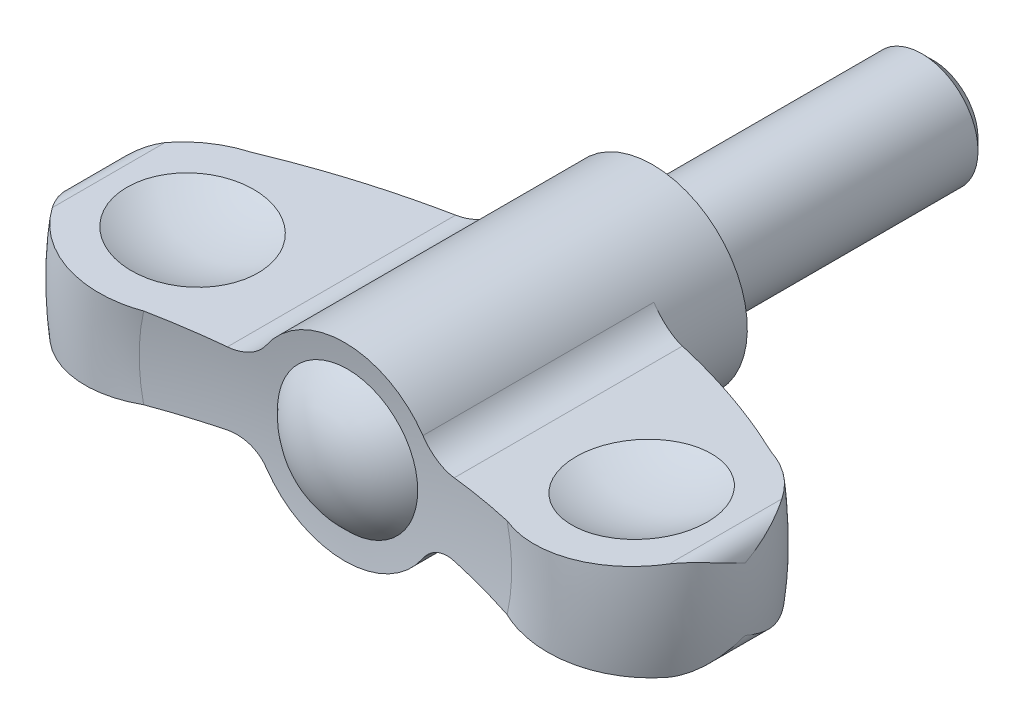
ISO-10303-21;
HEADER;
FILE_DESCRIPTION(('STEP AP214'),'2;1');
FILE_NAME('part.step','',(''),(''),'','','');
FILE_SCHEMA(('AUTOMOTIVE_DESIGN { 1 0 10303 214 1 1 1 1 }'));
ENDSEC;
DATA;
#1=APPLICATION_CONTEXT('core data for automotive mechanical design processes');
#2=APPLICATION_PROTOCOL_DEFINITION('international standard','automotive_design',2000,#1);
#3=PRODUCT_CONTEXT('',#1,'mechanical');
#4=PRODUCT('Part','Part','',(#3));
#5=PRODUCT_RELATED_PRODUCT_CATEGORY('part','',(#4));
#6=PRODUCT_DEFINITION_FORMATION('','',#4);
#7=PRODUCT_DEFINITION_CONTEXT('part definition',#1,'design');
#8=PRODUCT_DEFINITION('design','',#6,#7);
#9=PRODUCT_DEFINITION_SHAPE('','',#8);
#10=(LENGTH_UNIT() NAMED_UNIT(*) SI_UNIT(.MILLI.,.METRE.));
#11=(NAMED_UNIT(*) PLANE_ANGLE_UNIT() SI_UNIT($,.RADIAN.));
#12=(NAMED_UNIT(*) SI_UNIT($,.STERADIAN.) SOLID_ANGLE_UNIT());
#13=UNCERTAINTY_MEASURE_WITH_UNIT(LENGTH_MEASURE(1.E-05),#10,'distance_accuracy_value','');
#14=(GEOMETRIC_REPRESENTATION_CONTEXT(3) GLOBAL_UNCERTAINTY_ASSIGNED_CONTEXT((#13)) GLOBAL_UNIT_ASSIGNED_CONTEXT((#10,
#11,#12)) REPRESENTATION_CONTEXT('',''));
#15=CARTESIAN_POINT('',(0.,0.,0.));
#16=DIRECTION('',(0.,0.,1.));
#17=DIRECTION('',(1.,0.,0.));
#18=AXIS2_PLACEMENT_3D('',#15,#16,#17);
#19=CARTESIAN_POINT('',(0.,0.,60.8916836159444));
#20=DIRECTION('',(0.,0.,1.));
#21=DIRECTION('',(0.,1.,0.));
#22=AXIS2_PLACEMENT_3D('',#19,#20,#21);
#23=DEGENERATE_TOROIDAL_SURFACE('',#22,7.24809636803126,57.1330492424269,.F.);
#24=CARTESIAN_POINT('',(0.,0.,5.5));
#25=DIRECTION('',(0.,0.,1.));
#26=DIRECTION('',(0.,1.,0.));
#27=AXIS2_PLACEMENT_3D('',#24,#25,#26);
#28=CIRCLE('',#27,6.75);
#29=CARTESIAN_POINT('',(5.58468393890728,-3.79128016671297,5.5));
#30=VERTEX_POINT('',#29);
#31=CARTESIAN_POINT('',(5.58468393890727,3.79128016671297,5.5));
#32=VERTEX_POINT('',#31);
#33=EDGE_CURVE('E157',#30,#32,#28,.T.);
#34=ORIENTED_EDGE('',*,*,#33,.T.);
#35=CARTESIAN_POINT('',(5.58454817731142,3.79148016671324,5.5000000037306));
#36=CARTESIAN_POINT('',(5.6270350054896,3.72886637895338,5.49999203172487));
#37=CARTESIAN_POINT('',(5.67207292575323,3.66799067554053,5.50109190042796));
#38=CARTESIAN_POINT('',(5.76687239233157,3.55013742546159,5.50546469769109));
#39=CARTESIAN_POINT('',(5.81663303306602,3.49315913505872,5.5087372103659));
#40=CARTESIAN_POINT('',(5.92037232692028,3.3836500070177,5.51740071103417));
#41=CARTESIAN_POINT('',(5.97433893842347,3.33110730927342,5.5227858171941));
#42=CARTESIAN_POINT('',(6.08617319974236,3.23065312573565,5.53558959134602));
#43=CARTESIAN_POINT('',(6.14404090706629,3.1827417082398,5.54300828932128));
#44=CARTESIAN_POINT('',(6.32281948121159,3.04645743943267,5.56816484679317));
#45=CARTESIAN_POINT('',(6.44903201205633,2.9654018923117,5.58881397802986));
#46=CARTESIAN_POINT('',(6.71175482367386,2.82481579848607,5.63683026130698));
#47=CARTESIAN_POINT('',(6.84827321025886,2.76530241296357,5.66420274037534));
#48=CARTESIAN_POINT('',(7.13180529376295,2.66747892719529,5.72532830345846));
#49=CARTESIAN_POINT('',(7.27900617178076,2.62981214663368,5.75923917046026));
#50=CARTESIAN_POINT('',(7.57631968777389,2.57880440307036,5.83159976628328));
#51=CARTESIAN_POINT('',(7.72642802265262,2.56542990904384,5.87004316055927));
#52=CARTESIAN_POINT('',(7.91146899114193,2.56375196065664,5.91959867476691));
#53=CARTESIAN_POINT('',(7.94691227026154,2.56410633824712,5.92918950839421));
#54=CARTESIAN_POINT('',(8.01766035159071,2.56615563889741,5.94852854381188));
#55=CARTESIAN_POINT('',(8.05296528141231,2.56784856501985,5.958276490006));
#56=CARTESIAN_POINT('',(8.08821506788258,2.57020553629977,5.96810530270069));
#57=B_SPLINE_CURVE_WITH_KNOTS('',3,(#35,#36,#37,#38,#39,#40,#41,#42,#43,#44,#45,#46,#47,#48,#49,
#50,#51,#52,#53,#54,#55,#56),.UNSPECIFIED.,.F.,.F.,(4,2,2,2,2,2,2,2,2,2,4),(0.,
0.226923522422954,0.453803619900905,0.680056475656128,0.906312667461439,1.35828167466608,
1.81060994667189,2.27565813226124,2.74006391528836,2.85020967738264,2.96019142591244),.UNSPECIFIED.);
#58=CARTESIAN_POINT('',(8.08801506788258,2.57019216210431,5.96804953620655));
#59=VERTEX_POINT('',#58);
#60=EDGE_CURVE('E251',#32,#59,#57,.T.);
#61=ORIENTED_EDGE('',*,*,#60,.T.);
#62=CARTESIAN_POINT('',(18.5568278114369,3.2698755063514,10.0639861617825));
#63=CARTESIAN_POINT('',(17.7202118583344,3.21396025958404,9.63606709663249));
#64=CARTESIAN_POINT('',(16.8730027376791,3.15733701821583,9.22898268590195));
#65=CARTESIAN_POINT('',(15.1615683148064,3.04295325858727,8.45851890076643));
#66=CARTESIAN_POINT('',(14.2973907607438,2.98519593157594,8.09503297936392));
#67=CARTESIAN_POINT('',(12.5519653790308,2.86854038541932,7.41164455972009));
#68=CARTESIAN_POINT('',(11.6707170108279,2.80964213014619,7.09174344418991));
#69=CARTESIAN_POINT('',(10.3366076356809,2.72047689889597,6.64515483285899));
#70=CARTESIAN_POINT('',(9.88928279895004,2.6905799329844,6.5016730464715));
#71=CARTESIAN_POINT('',(8.99112522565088,2.63055155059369,6.22618011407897));
#72=CARTESIAN_POINT('',(8.54029244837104,2.6004201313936,6.0941691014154));
#73=CARTESIAN_POINT('',(8.08781506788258,2.57017879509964,5.96799377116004));
#74=B_SPLINE_CURVE_WITH_KNOTS('',3,(#62,#63,#64,#65,#66,#67,#68,#69,#70,#71,#72,#73),
.UNSPECIFIED.,.F.,.F.,(4,2,2,2,2,4),(0.,2.82377208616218,5.64049635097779,8.45730995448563,
9.86934742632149,11.2814013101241),.UNSPECIFIED.);
#75=CARTESIAN_POINT('',(18.5564367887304,3.26984937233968,10.0637861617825));
#76=VERTEX_POINT('',#75);
#77=EDGE_CURVE('E242',#76,#59,#74,.T.);
#78=ORIENTED_EDGE('',*,*,#77,.F.);
#79=CARTESIAN_POINT('',(0.,0.,10.0637861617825));
#80=DIRECTION('',(0.,0.,1.));
#81=DIRECTION('',(0.,1.,0.));
#82=AXIS2_PLACEMENT_3D('',#79,#80,#81);
#83=CIRCLE('',#82,18.8423263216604);
#84=CARTESIAN_POINT('',(18.5564367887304,-3.26984937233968,10.0637861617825));
#85=VERTEX_POINT('',#84);
#86=EDGE_CURVE('E402',#85,#76,#83,.T.);
#87=ORIENTED_EDGE('',*,*,#86,.F.);
#88=CARTESIAN_POINT('',(8.08781506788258,-2.57017879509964,5.96799377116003));
#89=CARTESIAN_POINT('',(8.43648524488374,-2.59348217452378,6.06521586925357));
#90=CARTESIAN_POINT('',(8.78418982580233,-2.6167210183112,6.16591362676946));
#91=CARTESIAN_POINT('',(9.47752423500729,-2.66306003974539,6.37414417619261));
#92=CARTESIAN_POINT('',(9.82315423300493,-2.68616022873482,6.48167640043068));
#93=CARTESIAN_POINT('',(10.8568675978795,-2.7552484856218,6.81439605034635));
#94=CARTESIAN_POINT('',(11.5417095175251,-2.80101991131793,7.04968835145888));
#95=CARTESIAN_POINT('',(13.5766416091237,-2.93702464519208,7.79319141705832));
#96=CARTESIAN_POINT('',(14.9128146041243,-3.02632779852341,8.34061833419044));
#97=CARTESIAN_POINT('',(16.6182429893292,-3.14031014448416,9.11672807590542));
#98=CARTESIAN_POINT('',(17.0086949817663,-3.16640601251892,9.29983650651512));
#99=CARTESIAN_POINT('',(17.785774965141,-3.21834217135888,9.67514693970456));
#100=CARTESIAN_POINT('',(18.1723980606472,-3.24418213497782,9.86735912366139));
#101=CARTESIAN_POINT('',(18.5568278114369,-3.2698755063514,10.0639861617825));
#102=B_SPLINE_CURVE_WITH_KNOTS('',3,(#88,#89,#90,#91,#92,#93,#94,#95,#96,#97,#98,#99,#100,#101),
.UNSPECIFIED.,.F.,.F.,(4,2,2,2,2,2,4),(0.,1.0881425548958,2.17619484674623,4.35250158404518,
8.68743833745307,9.98350841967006,11.2810638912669),.UNSPECIFIED.);
#103=CARTESIAN_POINT('',(8.08801506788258,-2.57019216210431,5.96804953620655));
#104=VERTEX_POINT('',#103);
#105=EDGE_CURVE('E232',#104,#85,#102,.T.);
#106=ORIENTED_EDGE('',*,*,#105,.F.);
#107=CARTESIAN_POINT('',(8.08821506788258,-2.57020553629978,5.96810530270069));
#108=CARTESIAN_POINT('',(8.00997344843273,-2.56497338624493,5.94629000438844));
#109=CARTESIAN_POINT('',(7.9314394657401,-2.5630200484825,5.92486614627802));
#110=CARTESIAN_POINT('',(7.77422277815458,-2.56573749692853,5.88295181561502));
#111=CARTESIAN_POINT('',(7.69554004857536,-2.57040950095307,5.862461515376));
#112=CARTESIAN_POINT('',(7.45993217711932,-2.59446790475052,5.80261995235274));
#113=CARTESIAN_POINT('',(7.30348188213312,-2.62389903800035,5.7649076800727));
#114=CARTESIAN_POINT('',(6.99637317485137,-2.7094115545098,5.69535012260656));
#115=CARTESIAN_POINT('',(6.84572761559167,-2.76554877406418,5.66351732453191));
#116=CARTESIAN_POINT('',(6.55526150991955,-2.90348395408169,5.60733410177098));
#117=CARTESIAN_POINT('',(6.4154250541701,-2.98524327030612,5.58297251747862));
#118=CARTESIAN_POINT('',(6.21564820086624,-3.12665619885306,5.55280138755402));
#119=CARTESIAN_POINT('',(6.14994832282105,-3.17769981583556,5.54373343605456));
#120=CARTESIAN_POINT('',(6.0231628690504,-3.28560819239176,5.52805647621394));
#121=CARTESIAN_POINT('',(5.96207731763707,-3.34247298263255,5.5214474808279));
#122=CARTESIAN_POINT('',(5.84481263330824,-3.46187538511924,5.51078652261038));
#123=CARTESIAN_POINT('',(5.78866161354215,-3.52444182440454,5.50674848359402));
#124=CARTESIAN_POINT('',(5.68213708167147,-3.65444758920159,5.50134928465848));
#125=CARTESIAN_POINT('',(5.63176510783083,-3.72188820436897,5.49998883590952));
#126=CARTESIAN_POINT('',(5.58454817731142,-3.79148016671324,5.50000000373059));
#127=B_SPLINE_CURVE_WITH_KNOTS('',3,(#107,#108,#109,#110,#111,#112,#113,#114,#115,#116,#117,
#118,#119,#120,#121,#122,#123,#124,#125,#126),.UNSPECIFIED.,.F.,.F.,(4,2,2,2,2,2,2,2,2,4),(0.,
0.244043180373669,0.488131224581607,0.976413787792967,1.46572175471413,1.95429525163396,
2.20506346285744,2.4558329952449,2.70794934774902,2.96013265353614),.UNSPECIFIED.);
#128=EDGE_CURVE('E222',#104,#30,#127,.T.);
#129=ORIENTED_EDGE('',*,*,#128,.T.);
#130=EDGE_LOOP('',(#34,#61,#78,#87,#106,#129));
#131=FACE_BOUND('',#130,.T.);
#132=ADVANCED_FACE('F14',(#131),#23,.F.);
#133=CARTESIAN_POINT('',(0.,0.,16.8));
#134=DIRECTION('',(0.,0.,1.));
#135=DIRECTION('',(0.,1.,0.));
#136=AXIS2_PLACEMENT_3D('',#133,#134,#135);
#137=TOROIDAL_SURFACE('',#136,16.3,7.2);
#138=CARTESIAN_POINT('',(-13.4430070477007,-2.92809317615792,10.0635861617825));
#139=CARTESIAN_POINT('',(-13.250045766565,-2.91519660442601,10.1357408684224));
#140=CARTESIAN_POINT('',(-13.0601324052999,-2.90250374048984,10.216071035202));
#141=CARTESIAN_POINT('',(-12.6877100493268,-2.8776128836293,10.3924240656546));
#142=CARTESIAN_POINT('',(-12.5052008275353,-2.86541487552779,10.4884464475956));
#143=CARTESIAN_POINT('',(-12.1489194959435,-2.84160280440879,10.6955091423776));
#144=CARTESIAN_POINT('',(-11.9751456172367,-2.8299886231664,10.8065463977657));
#145=CARTESIAN_POINT('',(-11.6375334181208,-2.8074243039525,11.042874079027));
#146=CARTESIAN_POINT('',(-11.47369496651,-2.79647415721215,11.1681643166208));
#147=CARTESIAN_POINT('',(-11.1570734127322,-2.77531274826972,11.4321870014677));
#148=CARTESIAN_POINT('',(-11.0042945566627,-2.76510176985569,11.5709245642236));
#149=CARTESIAN_POINT('',(-10.7109328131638,-2.74549493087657,11.8608983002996));
#150=CARTESIAN_POINT('',(-10.570354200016,-2.73609935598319,12.0121388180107));
#151=CARTESIAN_POINT('',(-10.3025713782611,-2.7182020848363,12.3259661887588));
#152=CARTESIAN_POINT('',(-10.1753613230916,-2.70969999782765,12.4885480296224));
#153=CARTESIAN_POINT('',(-9.93523518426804,-2.69365116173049,12.8239887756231));
#154=CARTESIAN_POINT('',(-9.82231883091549,-2.68610439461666,12.9968474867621));
#155=CARTESIAN_POINT('',(-9.61240942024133,-2.67207509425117,13.3504168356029));
#156=CARTESIAN_POINT('',(-9.51531257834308,-2.6655856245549,13.5310655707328));
#157=CARTESIAN_POINT('',(-9.33694719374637,-2.6536645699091,13.8999735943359));
#158=CARTESIAN_POINT('',(-9.2556730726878,-2.64823261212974,14.0882301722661));
#159=CARTESIAN_POINT('',(-9.10959731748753,-2.63846963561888,14.4711021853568));
#160=CARTESIAN_POINT('',(-9.0447989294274,-2.63413883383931,14.6657188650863));
#161=CARTESIAN_POINT('',(-8.93227844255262,-2.62661852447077,15.0598492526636));
#162=CARTESIAN_POINT('',(-8.88455601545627,-2.62342899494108,15.2593628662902));
#163=CARTESIAN_POINT('',(-8.80746852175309,-2.61827685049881,15.6574650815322));
#164=CARTESIAN_POINT('',(-8.77773054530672,-2.6162893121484,15.8559812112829));
#165=CARTESIAN_POINT('',(-8.73529826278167,-2.6134533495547,16.2548338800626));
#166=CARTESIAN_POINT('',(-8.7226036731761,-2.61260490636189,16.4551703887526));
#167=CARTESIAN_POINT('',(-8.71437606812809,-2.61205501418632,16.8561671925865));
#168=CARTESIAN_POINT('',(-8.71884052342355,-2.61235339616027,17.0568274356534));
#169=CARTESIAN_POINT('',(-8.74488386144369,-2.61409400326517,17.4570282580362));
#170=CARTESIAN_POINT('',(-8.76646264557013,-2.6155362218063,17.6565688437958));
#171=CARTESIAN_POINT('',(-8.82608238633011,-2.6195209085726,18.0500864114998));
#172=CARTESIAN_POINT('',(-8.86387061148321,-2.62204648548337,18.2441019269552));
#173=CARTESIAN_POINT('',(-8.95554073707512,-2.62817326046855,18.6283441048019));
#174=CARTESIAN_POINT('',(-9.00942811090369,-2.63177482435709,18.8185694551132));
#175=CARTESIAN_POINT('',(-9.13281555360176,-2.64002142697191,19.1937999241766));
#176=CARTESIAN_POINT('',(-9.20231107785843,-2.64466616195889,19.3788065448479));
#177=CARTESIAN_POINT('',(-9.35638258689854,-2.6549635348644,19.742479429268));
#178=CARTESIAN_POINT('',(-9.44096421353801,-2.66061654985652,19.9211432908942));
#179=CARTESIAN_POINT('',(-9.62545322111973,-2.67294687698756,20.2726485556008));
#180=CARTESIAN_POINT('',(-9.72550696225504,-2.6796339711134,20.4454127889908));
#181=CARTESIAN_POINT('',(-9.93957002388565,-2.69394088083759,20.7821124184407));
#182=CARTESIAN_POINT('',(-10.0535844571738,-2.70156103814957,20.9460445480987));
#183=CARTESIAN_POINT('',(-10.2946584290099,-2.71767322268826,21.263898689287));
#184=CARTESIAN_POINT('',(-10.4217143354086,-2.7261650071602,21.4178234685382));
#185=CARTESIAN_POINT('',(-10.688029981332,-2.74396421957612,21.7147703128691));
#186=CARTESIAN_POINT('',(-10.8272940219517,-2.75327193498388,21.8577885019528));
#187=CARTESIAN_POINT('',(-11.1201972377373,-2.77284812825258,22.1349543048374));
#188=CARTESIAN_POINT('',(-11.2740848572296,-2.78313321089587,22.2688382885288));
#189=CARTESIAN_POINT('',(-11.5924511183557,-2.80441122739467,22.5232972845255));
#190=CARTESIAN_POINT('',(-11.7569299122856,-2.81540417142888,22.6438721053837));
#191=CARTESIAN_POINT('',(-12.0953583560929,-2.83802304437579,22.8709220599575));
#192=CARTESIAN_POINT('',(-12.2693100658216,-2.84964911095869,22.9773941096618));
#193=CARTESIAN_POINT('',(-12.6253835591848,-2.87344729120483,23.175449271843));
#194=CARTESIAN_POINT('',(-12.8075027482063,-2.88561923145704,23.2670370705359));
#195=CARTESIAN_POINT('',(-13.1810420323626,-2.9105847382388,23.4357878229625));
#196=CARTESIAN_POINT('',(-13.37255033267,-2.92338419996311,23.5127547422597));
#197=CARTESIAN_POINT('',(-13.7613485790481,-2.94936953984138,23.6502587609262));
#198=CARTESIAN_POINT('',(-13.9586384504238,-2.96255541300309,23.7107960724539));
#199=CARTESIAN_POINT('',(-14.3576152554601,-2.98922103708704,23.8149976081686));
#200=CARTESIAN_POINT('',(-14.5593023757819,-3.00270080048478,23.8586611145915));
#201=CARTESIAN_POINT('',(-14.9656299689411,-3.02985771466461,23.9287762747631));
#202=CARTESIAN_POINT('',(-15.170270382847,-3.04353486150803,23.9552282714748));
#203=CARTESIAN_POINT('',(-15.5810553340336,-3.07098968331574,23.9907056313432));
#204=CARTESIAN_POINT('',(-15.7871999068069,-3.08476736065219,23.9997305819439));
#205=CARTESIAN_POINT('',(-16.1994347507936,-3.11231908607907,24.000257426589));
#206=CARTESIAN_POINT('',(-16.4055250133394,-3.1260931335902,23.9917658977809));
#207=CARTESIAN_POINT('',(-16.816299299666,-3.15354724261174,23.9572980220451));
#208=CARTESIAN_POINT('',(-17.0209829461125,-3.16722727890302,23.9313171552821));
#209=CARTESIAN_POINT('',(-17.4273317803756,-3.19438561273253,23.8620348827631));
#210=CARTESIAN_POINT('',(-17.6289980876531,-3.20786398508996,23.8187400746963));
#211=CARTESIAN_POINT('',(-18.0267250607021,-3.23444607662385,23.7154246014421));
#212=CARTESIAN_POINT('',(-18.2228121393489,-3.24755156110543,23.6555060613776));
#213=CARTESIAN_POINT('',(-18.6091495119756,-3.27337242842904,23.5192613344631));
#214=CARTESIAN_POINT('',(-18.7994018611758,-3.28608794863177,23.4429410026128));
#215=CARTESIAN_POINT('',(-19.1728922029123,-3.31105018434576,23.2743446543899));
#216=CARTESIAN_POINT('',(-19.3561252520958,-3.32329656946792,23.1820576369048));
#217=CARTESIAN_POINT('',(-19.7140940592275,-3.34722142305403,22.9822113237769));
#218=CARTESIAN_POINT('',(-19.8888301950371,-3.35889991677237,22.8746527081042));
#219=CARTESIAN_POINT('',(-20.2275235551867,-3.38153649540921,22.6457025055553));
#220=CARTESIAN_POINT('',(-20.3915386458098,-3.39249844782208,22.5243968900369));
#221=CARTESIAN_POINT('',(-20.7087215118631,-3.41369737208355,22.2682963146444));
#222=CARTESIAN_POINT('',(-20.8618896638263,-3.42393436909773,22.133501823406));
#223=CARTESIAN_POINT('',(-21.1559703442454,-3.44358925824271,21.851664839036));
#224=CARTESIAN_POINT('',(-21.296906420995,-3.45300872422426,21.704646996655));
#225=CARTESIAN_POINT('',(-21.565777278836,-3.47097871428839,21.3992346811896));
#226=CARTESIAN_POINT('',(-21.6937203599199,-3.47952979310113,21.240847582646));
#227=CARTESIAN_POINT('',(-21.8466005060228,-3.48974754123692,21.0342564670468));
#228=CARTESIAN_POINT('',(-21.8780226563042,-3.49184764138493,20.9907857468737));
#229=CARTESIAN_POINT('',(-21.9398602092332,-3.49598055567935,20.9031903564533));
#230=CARTESIAN_POINT('',(-21.9702765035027,-3.49801342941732,20.8590663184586));
#231=CARTESIAN_POINT('',(-22.0002000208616,-3.50001336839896,20.8146028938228));
#232=B_SPLINE_CURVE_WITH_KNOTS('',3,(#138,#139,#140,#141,#142,#143,#144,#145,#146,#147,#148,
#149,#150,#151,#152,#153,#154,#155,#156,#157,#158,#159,#160,#161,#162,#163,#164,#165,#166,#167,
#168,#169,#170,#171,#172,#173,#174,#175,#176,#177,#178,#179,#180,#181,#182,#183,#184,#185,#186,
#187,#188,#189,#190,#191,#192,#193,#194,#195,#196,#197,#198,#199,#200,#201,#202,#203,#204,#205,
#206,#207,#208,#209,#210,#211,#212,#213,#214,#215,#216,#217,#218,#219,#220,#221,#222,#223,#224,
#225,#226,#227,#228,#229,#230,#231),.UNSPECIFIED.,.F.,.F.,(4,2,2,2,2,2,2,2,2,2,2,2,2,2,2,2,2,2,
2,2,2,2,2,2,2,2,2,2,2,2,2,2,2,2,2,2,2,2,2,2,2,2,2,2,2,2,4),(0.,0.619053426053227,
1.23808785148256,1.85699641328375,2.47589680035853,3.09503355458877,3.71438635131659,
4.33346714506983,4.95253625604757,5.56736438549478,6.18197536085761,6.79670733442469,
7.41142748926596,8.01292036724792,8.61440323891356,9.21579745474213,9.81718820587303,
10.4095249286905,11.0020632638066,11.5944292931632,12.1870173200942,12.7855991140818,
13.3844007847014,13.9830361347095,14.5818832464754,15.1938756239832,15.8058768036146,
16.4180115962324,17.029953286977,17.6495959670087,18.2692306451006,18.8888916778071,
19.5085403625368,20.1282037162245,20.7476344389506,21.3672253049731,21.9865802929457,
22.6022115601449,23.217623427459,23.8334610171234,24.4492711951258,25.0614231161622,
25.6735537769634,26.2844785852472,26.8950106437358,27.0560402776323,27.216923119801),.UNSPECIFIED.);
#233=CARTESIAN_POINT('',(-12.9627653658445,-2.89599621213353,23.3370956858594));
#234=VERTEX_POINT('',#233);
#235=CARTESIAN_POINT('',(-22.0000000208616,-3.5,20.8149000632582));
#236=VERTEX_POINT('',#235);
#237=EDGE_CURVE('E276',#234,#236,#232,.T.);
#238=ORIENTED_EDGE('',*,*,#237,.F.);
#239=CARTESIAN_POINT('',(0.,0.,23.3370956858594));
#240=DIRECTION('',(0.,0.,1.));
#241=DIRECTION('',(0.,1.,0.));
#242=AXIS2_PLACEMENT_3D('',#239,#240,#241);
#243=CIRCLE('',#242,13.2823220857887);
#244=CARTESIAN_POINT('',(-12.9627653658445,2.89599621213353,23.3370956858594));
#245=VERTEX_POINT('',#244);
#246=EDGE_CURVE('E210',#245,#234,#243,.T.);
#247=ORIENTED_EDGE('',*,*,#246,.F.);
#248=CARTESIAN_POINT('',(-22.0002,3.50001336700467,20.8146029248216));
#249=CARTESIAN_POINT('',(-21.8869659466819,3.49244536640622,20.9829001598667));
#250=CARTESIAN_POINT('',(-21.7665908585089,3.48440009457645,21.1463645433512));
#251=CARTESIAN_POINT('',(-21.5125154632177,3.46741895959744,21.4625195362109));
#252=CARTESIAN_POINT('',(-21.378816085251,3.45848315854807,21.6152108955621));
#253=CARTESIAN_POINT('',(-21.0991608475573,3.43979239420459,21.9086013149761));
#254=CARTESIAN_POINT('',(-20.9532163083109,3.43003818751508,22.0493112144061));
#255=CARTESIAN_POINT('',(-20.6500231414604,3.4097742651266,22.3179109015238));
#256=CARTESIAN_POINT('',(-20.4927745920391,3.399264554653,22.445800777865));
#257=CARTESIAN_POINT('',(-20.1680719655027,3.377563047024,22.6878898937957));
#258=CARTESIAN_POINT('',(-20.0006161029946,3.36637113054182,22.8020867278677));
#259=CARTESIAN_POINT('',(-19.6566594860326,3.34338278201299,23.0160136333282));
#260=CARTESIAN_POINT('',(-19.4801554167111,3.33158612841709,23.1157383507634));
#261=CARTESIAN_POINT('',(-19.1195107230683,3.3074824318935,23.299940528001));
#262=CARTESIAN_POINT('',(-18.9353740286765,3.29517565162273,23.3844257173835));
#263=CARTESIAN_POINT('',(-18.5606181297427,3.27012883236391,23.5376689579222));
#264=CARTESIAN_POINT('',(-18.369996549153,3.25738863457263,23.6064211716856));
#265=CARTESIAN_POINT('',(-17.9830362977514,3.23152613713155,23.7279050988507));
#266=CARTESIAN_POINT('',(-17.7866806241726,3.21840270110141,23.780582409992));
#267=CARTESIAN_POINT('',(-17.3901835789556,3.19190281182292,23.8692781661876));
#268=CARTESIAN_POINT('',(-17.1900408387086,3.17852626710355,23.9052904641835));
#269=CARTESIAN_POINT('',(-16.7874574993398,3.15161960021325,23.9604036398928));
#270=CARTESIAN_POINT('',(-16.5850169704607,3.13808948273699,23.9795050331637));
#271=CARTESIAN_POINT('',(-16.1792478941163,3.11096989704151,24.0006952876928));
#272=CARTESIAN_POINT('',(-15.9759193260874,3.09738042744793,24.0027837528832));
#273=CARTESIAN_POINT('',(-15.5684666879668,3.07014832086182,23.9899203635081));
#274=CARTESIAN_POINT('',(-15.364346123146,3.05650591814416,23.9748568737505));
#275=CARTESIAN_POINT('',(-14.9580777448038,3.02935296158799,23.9276425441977));
#276=CARTESIAN_POINT('',(-14.755929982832,3.01584241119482,23.8954912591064));
#277=CARTESIAN_POINT('',(-14.3550670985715,2.98905073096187,23.814360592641));
#278=CARTESIAN_POINT('',(-14.1563513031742,2.97576955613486,23.7653845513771));
#279=CARTESIAN_POINT('',(-13.7636331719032,2.94952223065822,23.6509482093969));
#280=CARTESIAN_POINT('',(-13.5696323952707,2.9365561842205,23.5854825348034));
#281=CARTESIAN_POINT('',(-13.1865164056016,2.91095061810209,23.4380671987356));
#282=CARTESIAN_POINT('',(-12.9974412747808,2.89831377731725,23.356012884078));
#283=CARTESIAN_POINT('',(-12.6268363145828,2.87354438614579,23.1762764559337));
#284=CARTESIAN_POINT('',(-12.4453065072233,2.86141183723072,23.078594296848));
#285=CARTESIAN_POINT('',(-12.0910342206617,2.83773404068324,22.8682633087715));
#286=CARTESIAN_POINT('',(-11.9182938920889,2.8261889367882,22.7556108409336));
#287=CARTESIAN_POINT('',(-11.5829402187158,2.80377556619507,22.516182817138));
#288=CARTESIAN_POINT('',(-11.4203233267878,2.79290706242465,22.3894122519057));
#289=CARTESIAN_POINT('',(-11.1059013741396,2.77189266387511,22.1222291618));
#290=CARTESIAN_POINT('',(-10.9541266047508,2.76174879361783,21.9817808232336));
#291=CARTESIAN_POINT('',(-10.6630509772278,2.74229474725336,21.6885550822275));
#292=CARTESIAN_POINT('',(-10.5237454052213,2.73298425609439,21.5357823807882));
#293=CARTESIAN_POINT('',(-10.2585504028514,2.71525994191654,21.2188580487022));
#294=CARTESIAN_POINT('',(-10.1326659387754,2.7068464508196,21.0547022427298));
#295=CARTESIAN_POINT('',(-9.89540453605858,2.69098907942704,20.7162706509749));
#296=CARTESIAN_POINT('',(-9.78402188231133,2.68354481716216,20.5419988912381));
#297=CARTESIAN_POINT('',(-9.57753567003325,2.66974430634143,20.1860989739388));
#298=CARTESIAN_POINT('',(-9.48229586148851,2.66337895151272,20.0045502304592));
#299=CARTESIAN_POINT('',(-9.30772151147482,2.65171127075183,19.6340070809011));
#300=CARTESIAN_POINT('',(-9.22838099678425,2.64640854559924,19.445015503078));
#301=CARTESIAN_POINT('',(-9.0862443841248,2.6369088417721,19.0608700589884));
#302=CARTESIAN_POINT('',(-9.02344908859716,2.63271191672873,18.8657158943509));
#303=CARTESIAN_POINT('',(-8.91497467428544,2.62546202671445,18.4706862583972));
#304=CARTESIAN_POINT('',(-8.86929523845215,2.62240904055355,18.2708108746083));
#305=CARTESIAN_POINT('',(-8.79627719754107,2.61752887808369,17.8722020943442));
#306=CARTESIAN_POINT('',(-8.76856256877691,2.61567657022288,17.6735378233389));
#307=CARTESIAN_POINT('',(-8.73017446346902,2.61311090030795,17.2745631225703));
#308=CARTESIAN_POINT('',(-8.71950071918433,2.61239752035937,17.0742527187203));
#309=CARTESIAN_POINT('',(-8.71529310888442,2.61211630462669,16.6734663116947));
#310=CARTESIAN_POINT('',(-8.72175798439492,2.61254838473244,16.4729903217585));
#311=CARTESIAN_POINT('',(-8.75176494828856,2.61455390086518,16.0733272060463));
#312=CARTESIAN_POINT('',(-8.77530694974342,2.61612733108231,15.8741400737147));
#313=CARTESIAN_POINT('',(-8.83878915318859,2.62037016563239,15.481363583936));
#314=CARTESIAN_POINT('',(-8.87848770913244,2.62302341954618,15.2877349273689));
#315=CARTESIAN_POINT('',(-8.97393104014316,2.62940237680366,14.9044232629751));
#316=CARTESIAN_POINT('',(-9.029681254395,2.6331284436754,14.7147416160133));
#317=CARTESIAN_POINT('',(-9.15673580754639,2.64162013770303,14.3407362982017));
#318=CARTESIAN_POINT('',(-9.2280365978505,2.64638552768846,14.1564114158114));
#319=CARTESIAN_POINT('',(-9.38562068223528,2.65691766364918,13.7943056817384));
#320=CARTESIAN_POINT('',(-9.47190458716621,2.66268445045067,13.6165250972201));
#321=CARTESIAN_POINT('',(-9.65980249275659,2.67524261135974,13.2667770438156));
#322=CARTESIAN_POINT('',(-9.76157423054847,2.68204452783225,13.094894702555));
#323=CARTESIAN_POINT('',(-9.97895442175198,2.69657313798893,12.7601587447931));
#324=CARTESIAN_POINT('',(-10.094562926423,2.70429983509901,12.5973051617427));
#325=CARTESIAN_POINT('',(-10.3388280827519,2.72062530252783,12.28159984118));
#326=CARTESIAN_POINT('',(-10.4674919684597,2.72922455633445,12.1287537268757));
#327=CARTESIAN_POINT('',(-10.7368892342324,2.74722972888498,11.8341521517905));
#328=CARTESIAN_POINT('',(-10.8776225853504,2.75663564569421,11.6923966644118));
#329=CARTESIAN_POINT('',(-11.1735584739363,2.77641452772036,11.4177499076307));
#330=CARTESIAN_POINT('',(-11.3290201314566,2.78680481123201,11.2851390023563));
#331=CARTESIAN_POINT('',(-11.6503816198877,2.80828301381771,11.0334204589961));
#332=CARTESIAN_POINT('',(-11.8162777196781,2.81937068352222,10.914308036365));
#333=CARTESIAN_POINT('',(-12.1571151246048,2.8421505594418,10.690516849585));
#334=CARTESIAN_POINT('',(-12.3320419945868,2.85384180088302,10.5858159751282));
#335=CARTESIAN_POINT('',(-12.6898958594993,2.87775897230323,10.3913862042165));
#336=CARTESIAN_POINT('',(-12.8728180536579,2.88998458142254,10.3016484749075));
#337=CARTESIAN_POINT('',(-13.1223586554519,2.90666263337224,10.1918600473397));
#338=CARTESIAN_POINT('',(-13.1860214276,2.9109175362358,10.1649193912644));
#339=CARTESIAN_POINT('',(-13.3140099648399,2.91947165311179,10.1128788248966));
#340=CARTESIAN_POINT('',(-13.3783349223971,2.92377081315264,10.0877769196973));
#341=CARTESIAN_POINT('',(-13.4430070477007,2.92809317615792,10.0635861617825));
#342=B_SPLINE_CURVE_WITH_KNOTS('',3,(#248,#249,#250,#251,#252,#253,#254,#255,#256,#257,#258,
#259,#260,#261,#262,#263,#264,#265,#266,#267,#268,#269,#270,#271,#272,#273,#274,#275,#276,#277,
#278,#279,#280,#281,#282,#283,#284,#285,#286,#287,#288,#289,#290,#291,#292,#293,#294,#295,#296,
#297,#298,#299,#300,#301,#302,#303,#304,#305,#306,#307,#308,#309,#310,#311,#312,#313,#314,#315,
#316,#317,#318,#319,#320,#321,#322,#323,#324,#325,#326,#327,#328,#329,#330,#331,#332,#333,#334,
#335,#336,#337,#338,#339,#340,#341),.UNSPECIFIED.,.F.,.F.,(4,2,2,2,2,2,2,2,2,2,2,2,2,2,2,2,2,2,
2,2,2,2,2,2,2,2,2,2,2,2,2,2,2,2,2,2,2,2,2,2,2,2,2,2,2,2,4),(0.,0.608767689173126,
1.21749295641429,1.82566153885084,2.43382591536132,3.04209697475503,3.65059249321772,
4.25877850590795,4.86718980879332,5.47763788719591,6.08831095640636,6.698965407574,
7.30963407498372,7.92430017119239,8.53898228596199,9.15354244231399,9.76830314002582,
10.387070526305,11.0058397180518,11.6247595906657,12.2434613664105,12.8638290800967,
13.4839612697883,14.1043221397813,14.7244377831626,15.3390262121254,15.9533833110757,
16.5677702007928,17.1821457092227,17.7832066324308,18.3842581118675,18.9852654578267,
19.5862697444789,20.1785973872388,20.7711259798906,21.3635195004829,21.9559371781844,
22.5548514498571,23.1537679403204,23.7530181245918,24.3522668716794,24.9653566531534,
25.5782284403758,26.1901492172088,26.8017074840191,27.0094652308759,27.2169941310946),.UNSPECIFIED.);
#343=CARTESIAN_POINT('',(-22.,3.5,20.8149000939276));
#344=VERTEX_POINT('',#343);
#345=EDGE_CURVE('E298',#344,#245,#342,.T.);
#346=ORIENTED_EDGE('',*,*,#345,.F.);
#347=CARTESIAN_POINT('',(-23.3936651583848,2.23303167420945,16.8));
#348=CARTESIAN_POINT('',(-23.3934426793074,2.23536251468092,16.8051493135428));
#349=CARTESIAN_POINT('',(-23.3932143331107,2.23769289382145,16.8102988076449));
#350=CARTESIAN_POINT('',(-23.3743145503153,2.42570445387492,17.2258528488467));
#351=CARTESIAN_POINT('',(-23.3183956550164,2.60830531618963,17.6373544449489));
#352=CARTESIAN_POINT('',(-23.1798743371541,2.85965877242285,18.2505518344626));
#353=CARTESIAN_POINT('',(-23.1245479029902,2.939723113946,18.4543861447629));
#354=CARTESIAN_POINT('',(-22.9956909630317,3.08909813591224,18.8603432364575));
#355=CARTESIAN_POINT('',(-22.9221687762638,3.1584137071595,19.0624667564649));
#356=CARTESIAN_POINT('',(-22.7850793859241,3.26116367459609,19.3959296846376));
#357=CARTESIAN_POINT('',(-22.7265638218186,3.29880232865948,19.5280746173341));
#358=CARTESIAN_POINT('',(-22.6018254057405,3.36602668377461,19.7906656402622));
#359=CARTESIAN_POINT('',(-22.5356088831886,3.39561893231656,19.9211130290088));
#360=CARTESIAN_POINT('',(-22.395316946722,3.44509635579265,20.180513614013));
#361=CARTESIAN_POINT('',(-22.3212053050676,3.46493421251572,20.3094566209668));
#362=CARTESIAN_POINT('',(-22.2046559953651,3.48552373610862,20.500765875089));
#363=CARTESIAN_POINT('',(-22.1648550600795,3.49085996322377,20.5642643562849));
#364=CARTESIAN_POINT('',(-22.0835651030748,3.49809816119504,20.6904076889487));
#365=CARTESIAN_POINT('',(-22.0420753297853,3.49999858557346,20.7530521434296));
#366=CARTESIAN_POINT('',(-21.9998,3.49999998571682,20.8151941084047));
#367=B_SPLINE_CURVE_WITH_KNOTS('',3,(#347,#348,#349,#350,#351,#352,#353,#354,#355,#356,#357,
#358,#359,#360,#361,#362,#363,#364,#365,#366),.UNSPECIFIED.,.F.,.F.,(4,2,2,2,2,2,2,2,2,4),(0.,
0.016970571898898,1.36944581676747,2.04642868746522,2.72310261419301,3.17077232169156,
3.61807665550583,4.06752995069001,4.29283181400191,4.51823506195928),.UNSPECIFIED.);
#368=CARTESIAN_POINT('',(-23.3936651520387,2.23303174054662,16.8));
#369=VERTEX_POINT('',#368);
#370=EDGE_CURVE('E360',#369,#344,#367,.T.);
#371=ORIENTED_EDGE('',*,*,#370,.F.);
#372=CARTESIAN_POINT('',(-21.9998,3.49999998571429,12.7848058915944));
#373=CARTESIAN_POINT('',(-22.0666741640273,3.49996244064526,12.8830879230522));
#374=CARTESIAN_POINT('',(-22.1315514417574,3.4952325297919,12.9826100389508));
#375=CARTESIAN_POINT('',(-22.2568815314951,3.47769367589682,13.1835115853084));
#376=CARTESIAN_POINT('',(-22.3173409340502,3.46489705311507,13.2848879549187));
#377=CARTESIAN_POINT('',(-22.4333648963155,3.43259083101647,13.4887461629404));
#378=CARTESIAN_POINT('',(-22.4889490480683,3.41310980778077,13.5912215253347));
#379=CARTESIAN_POINT('',(-22.5953729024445,3.3684102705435,13.7974289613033));
#380=CARTESIAN_POINT('',(-22.6462099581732,3.34318858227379,13.9011616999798));
#381=CARTESIAN_POINT('',(-22.774089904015,3.2701146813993,14.1765334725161));
#382=CARTESIAN_POINT('',(-22.8470051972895,3.21812877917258,14.3490158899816));
#383=CARTESIAN_POINT('',(-22.9794561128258,3.10414337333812,14.695745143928));
#384=CARTESIAN_POINT('',(-23.0389856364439,3.04213932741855,14.8699927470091));
#385=CARTESIAN_POINT('',(-23.1975205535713,2.84462859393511,15.3951794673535));
#386=CARTESIAN_POINT('',(-23.2763283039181,2.6977147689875,15.7482515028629));
#387=CARTESIAN_POINT('',(-23.3443046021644,2.49442989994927,16.2153989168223));
#388=CARTESIAN_POINT('',(-23.3580236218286,2.44419371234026,16.3292368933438));
#389=CARTESIAN_POINT('',(-23.3797700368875,2.34273549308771,16.5569077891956));
#390=CARTESIAN_POINT('',(-23.3878040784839,2.29151468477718,16.6707405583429));
#391=CARTESIAN_POINT('',(-23.3932143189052,2.23769296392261,16.7897010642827));
#392=CARTESIAN_POINT('',(-23.3934426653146,2.23536258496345,16.7948505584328));
#393=CARTESIAN_POINT('',(-23.3936651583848,2.23303167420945,16.8));
#394=B_SPLINE_CURVE_WITH_KNOTS('',3,(#372,#373,#374,#375,#376,#377,#378,#379,#380,#381,#382,
#383,#384,#385,#386,#387,#388,#389,#390,#391,#392,#393),.UNSPECIFIED.,.F.,.F.,(4,2,2,2,2,2,2,2,
2,2,4),(0.,0.356372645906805,0.712202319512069,1.06652937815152,1.42105283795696,
2.00316709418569,2.58554603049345,3.75135617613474,4.12686584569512,4.5019357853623,
4.51890635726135),.UNSPECIFIED.);
#395=CARTESIAN_POINT('',(-22.,3.5,12.7850999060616));
#396=VERTEX_POINT('',#395);
#397=EDGE_CURVE('E354',#396,#369,#394,.T.);
#398=ORIENTED_EDGE('',*,*,#397,.F.);
#399=CARTESIAN_POINT('',(-18.5559048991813,3.26981382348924,10.0635861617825));
#400=CARTESIAN_POINT('',(-18.7481532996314,3.28266274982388,10.1358408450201));
#401=CARTESIAN_POINT('',(-18.9373210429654,3.29530578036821,10.2163336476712));
#402=CARTESIAN_POINT('',(-19.308161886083,3.32009093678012,10.3931469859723));
#403=CARTESIAN_POINT('',(-19.4898343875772,3.332233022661,10.4894687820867));
#404=CARTESIAN_POINT('',(-19.8398224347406,3.35562448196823,10.6946430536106));
#405=CARTESIAN_POINT('',(-20.0083599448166,3.36688869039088,10.8031155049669));
#406=CARTESIAN_POINT('',(-20.3358278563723,3.38877501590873,11.0337190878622));
#407=CARTESIAN_POINT('',(-20.4947599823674,3.39939724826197,11.1558477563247));
#408=CARTESIAN_POINT('',(-20.7764213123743,3.41822208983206,11.3915935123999));
#409=CARTESIAN_POINT('',(-20.9007819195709,3.42653373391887,11.5032605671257));
#410=CARTESIAN_POINT('',(-21.141456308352,3.44261921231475,11.7349898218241));
#411=CARTESIAN_POINT('',(-21.2577703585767,3.45039306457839,11.8550517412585));
#412=CARTESIAN_POINT('',(-21.4842055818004,3.46552686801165,12.105686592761));
#413=CARTESIAN_POINT('',(-21.5941379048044,3.47287419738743,12.2364309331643));
#414=CARTESIAN_POINT('',(-21.8044661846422,3.48693149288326,12.5054420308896));
#415=CARTESIAN_POINT('',(-21.9048606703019,3.49364136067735,12.6437099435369));
#416=CARTESIAN_POINT('',(-22.0002,3.50001336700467,12.7853970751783));
#417=B_SPLINE_CURVE_WITH_KNOTS('',3,(#399,#400,#401,#402,#403,#404,#405,#406,#407,#408,#409,
#410,#411,#412,#413,#414,#415,#416),.UNSPECIFIED.,.F.,.F.,(4,2,2,2,2,2,2,2,4),(0.,
0.617158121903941,1.23436541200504,1.83590974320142,2.43734575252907,2.93898887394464,
3.44061523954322,3.95311321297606,4.46569010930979),.UNSPECIFIED.);
#418=CARTESIAN_POINT('',(-18.5564367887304,3.26984937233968,10.0637861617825));
#419=VERTEX_POINT('',#418);
#420=EDGE_CURVE('E277',#419,#396,#417,.T.);
#421=ORIENTED_EDGE('',*,*,#420,.F.);
#422=CARTESIAN_POINT('',(-18.5564367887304,-3.26984937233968,10.0637861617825));
#423=VERTEX_POINT('',#422);
#424=EDGE_CURVE('E399',#419,#423,#83,.T.);
#425=ORIENTED_EDGE('',*,*,#424,.T.);
#426=CARTESIAN_POINT('',(-22.0002000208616,-3.50001336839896,12.7853971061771));
#427=CARTESIAN_POINT('',(-21.8855721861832,-3.49235221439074,12.6150255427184));
#428=CARTESIAN_POINT('',(-21.7636225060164,-3.48420170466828,12.4496052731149));
#429=CARTESIAN_POINT('',(-21.5060663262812,-3.46698793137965,12.1298039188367));
#430=CARTESIAN_POINT('',(-21.3704594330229,-3.45792464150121,11.9754231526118));
#431=CARTESIAN_POINT('',(-21.0901761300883,-3.43919190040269,11.6826018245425));
#432=CARTESIAN_POINT('',(-20.9458162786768,-3.42954360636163,11.5438566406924));
#433=CARTESIAN_POINT('',(-20.6460984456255,-3.4095119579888,11.2788991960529));
#434=CARTESIAN_POINT('',(-20.4907422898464,-3.39912872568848,11.1526848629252));
#435=CARTESIAN_POINT('',(-20.1963110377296,-3.3794504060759,10.9331636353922));
#436=CARTESIAN_POINT('',(-20.058720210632,-3.37025451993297,10.8378487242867));
#437=CARTESIAN_POINT('',(-19.7772660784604,-3.35144352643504,10.6570247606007));
#438=CARTESIAN_POINT('',(-19.6334029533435,-3.34182843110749,10.571515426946));
#439=CARTESIAN_POINT('',(-19.3369202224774,-3.32201300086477,10.4089623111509));
#440=CARTESIAN_POINT('',(-19.1841783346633,-3.31180449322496,10.3321425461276));
#441=CARTESIAN_POINT('',(-18.8736362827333,-3.29104940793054,10.1895126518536));
#442=CARTESIAN_POINT('',(-18.7158354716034,-3.28050278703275,10.123703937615));
#443=CARTESIAN_POINT('',(-18.5559048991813,-3.26981382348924,10.0635861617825));
#444=B_SPLINE_CURVE_WITH_KNOTS('',3,(#426,#427,#428,#429,#430,#431,#432,#433,#434,#435,#436,
#437,#438,#439,#440,#441,#442,#443),.UNSPECIFIED.,.F.,.F.,(4,2,2,2,2,2,2,2,4),(0.,
0.616269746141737,1.23255726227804,1.83324114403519,2.43382551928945,2.93633271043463,
3.43882549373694,3.95222439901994,4.46568922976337),.UNSPECIFIED.);
#445=CARTESIAN_POINT('',(-22.0000000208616,-3.5,12.7850999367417));
#446=VERTEX_POINT('',#445);
#447=EDGE_CURVE('E530',#446,#423,#444,.T.);
#448=ORIENTED_EDGE('',*,*,#447,.F.);
#449=CARTESIAN_POINT('',(-23.3936651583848,-2.23303167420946,16.8));
#450=CARTESIAN_POINT('',(-23.3934426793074,-2.23536251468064,16.794850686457));
#451=CARTESIAN_POINT('',(-23.3932143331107,-2.23769289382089,16.7897011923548));
#452=CARTESIAN_POINT('',(-23.3743145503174,-2.42570445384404,16.374147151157));
#453=CARTESIAN_POINT('',(-23.3183956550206,-2.60830531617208,15.9626455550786));
#454=CARTESIAN_POINT('',(-23.1798743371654,-2.85965877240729,15.349448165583));
#455=CARTESIAN_POINT('',(-23.1245479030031,-2.93972311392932,15.1456138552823));
#456=CARTESIAN_POINT('',(-22.9956909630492,-3.0890981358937,14.739656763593));
#457=CARTESIAN_POINT('',(-22.922168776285,-3.15841370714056,14.5375332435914));
#458=CARTESIAN_POINT('',(-22.7850793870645,-3.26116367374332,14.2040703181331));
#459=CARTESIAN_POINT('',(-22.7265638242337,-3.29880232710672,14.0719253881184));
#460=CARTESIAN_POINT('',(-22.6018254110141,-3.36602668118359,13.8093343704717));
#461=CARTESIAN_POINT('',(-22.5356088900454,-3.39561892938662,13.6788869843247));
#462=CARTESIAN_POINT('',(-22.3953169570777,-3.44509635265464,13.4194864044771));
#463=CARTESIAN_POINT('',(-22.3212053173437,-3.46493420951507,13.2905434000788));
#464=CARTESIAN_POINT('',(-22.2046560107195,-3.48552373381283,13.0992341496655));
#465=CARTESIAN_POINT('',(-22.1648550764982,-3.49085996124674,13.035735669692));
#466=CARTESIAN_POINT('',(-22.083565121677,-3.49809816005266,12.9095923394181));
#467=CARTESIAN_POINT('',(-22.0420753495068,-3.49999858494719,12.8469478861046));
#468=CARTESIAN_POINT('',(-21.9998000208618,-3.4999999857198,12.784805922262));
#469=B_SPLINE_CURVE_WITH_KNOTS('',3,(#449,#450,#451,#452,#453,#454,#455,#456,#457,#458,#459,
#460,#461,#462,#463,#464,#465,#466,#467,#468),.UNSPECIFIED.,.F.,.F.,(4,2,2,2,2,2,2,2,2,4),(0.,
0.0169705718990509,1.36944581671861,2.0464286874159,2.72310261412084,3.17077231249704,
3.61807663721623,4.06752992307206,4.29283178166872,4.51823502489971),.UNSPECIFIED.);
#470=CARTESIAN_POINT('',(-23.393665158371,-2.23303167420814,16.8));
#471=VERTEX_POINT('',#470);
#472=EDGE_CURVE('E372',#471,#446,#469,.T.);
#473=ORIENTED_EDGE('',*,*,#472,.F.);
#474=CARTESIAN_POINT('',(-21.9998000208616,-3.49999998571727,20.8151940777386));
#475=CARTESIAN_POINT('',(-22.0666741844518,-3.49996243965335,20.7169120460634));
#476=CARTESIAN_POINT('',(-22.1315514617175,-3.49523252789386,20.617389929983));
#477=CARTESIAN_POINT('',(-22.2568815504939,-3.47769367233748,20.4164883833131));
#478=CARTESIAN_POINT('',(-22.3173409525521,-3.46489704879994,20.315112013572));
#479=CARTESIAN_POINT('',(-22.4333649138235,-3.43259082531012,20.111253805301));
#480=CARTESIAN_POINT('',(-22.488949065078,-3.41310980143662,20.0087784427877));
#481=CARTESIAN_POINT('',(-22.5953729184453,-3.36841026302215,19.802571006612));
#482=CARTESIAN_POINT('',(-22.6462099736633,-3.34318857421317,19.6988382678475));
#483=CARTESIAN_POINT('',(-22.7740899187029,-3.27011467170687,19.4234664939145));
#484=CARTESIAN_POINT('',(-22.8470052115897,-3.21812876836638,19.2509840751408));
#485=CARTESIAN_POINT('',(-22.9794561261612,-3.10414336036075,18.9042548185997));
#486=CARTESIAN_POINT('',(-23.0389856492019,-3.04213931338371,18.7300072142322));
#487=CARTESIAN_POINT('',(-23.1975205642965,-2.84462857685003,18.2048204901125));
#488=CARTESIAN_POINT('',(-23.2763283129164,-2.69771475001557,17.8517484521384));
#489=CARTESIAN_POINT('',(-23.3443046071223,-2.49442988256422,17.3846010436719));
#490=CARTESIAN_POINT('',(-23.3580236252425,-2.44419369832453,17.2707630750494));
#491=CARTESIAN_POINT('',(-23.379770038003,-2.34273548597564,17.0430921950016));
#492=CARTESIAN_POINT('',(-23.3878040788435,-2.29151468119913,16.9292594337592));
#493=CARTESIAN_POINT('',(-23.3932143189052,-2.23769296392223,16.8102989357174));
#494=CARTESIAN_POINT('',(-23.3934426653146,-2.23536258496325,16.8051494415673));
#495=CARTESIAN_POINT('',(-23.3936651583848,-2.23303167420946,16.8));
#496=B_SPLINE_CURVE_WITH_KNOTS('',3,(#474,#475,#476,#477,#478,#479,#480,#481,#482,#483,#484,
#485,#486,#487,#488,#489,#490,#491,#492,#493,#494,#495),.UNSPECIFIED.,.F.,.F.,(4,2,2,2,2,2,2,2,
2,2,4),(0.,0.356372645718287,0.712202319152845,1.0665293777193,1.42105283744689,
2.00316709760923,2.58554603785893,3.75135619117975,4.12686583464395,4.50193574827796,
4.51890632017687),.UNSPECIFIED.);
#497=EDGE_CURVE('E366',#236,#471,#496,.T.);
#498=ORIENTED_EDGE('',*,*,#497,.F.);
#499=EDGE_LOOP('',(#238,#247,#346,#371,#398,#421,#425,#448,#473,#498));
#500=FACE_BOUND('',#499,.T.);
#501=ADVANCED_FACE('F391',(#500),#137,.T.);
#502=CARTESIAN_POINT('',(0.,0.,0.));
#503=DIRECTION('',(0.,0.,1.));
#504=DIRECTION('',(0.,1.,0.));
#505=AXIS2_PLACEMENT_3D('',#502,#503,#504);
#506=PLANE('',#505);
#507=CARTESIAN_POINT('',(0.,0.,0.));
#508=DIRECTION('',(0.,0.,1.));
#509=DIRECTION('',(0.,1.,0.));
#510=AXIS2_PLACEMENT_3D('',#507,#508,#509);
#511=CIRCLE('',#510,4.);
#512=CARTESIAN_POINT('',(0.,4.,0.));
#513=VERTEX_POINT('',#512);
#514=EDGE_CURVE('E552',#513,#513,#511,.F.);
#515=ORIENTED_EDGE('',*,*,#514,.F.);
#516=EDGE_LOOP('',(#515));
#517=FACE_BOUND('',#516,.T.);
#518=CARTESIAN_POINT('',(0.,0.,0.));
#519=DIRECTION('',(0.,0.,1.));
#520=DIRECTION('',(0.,1.,0.));
#521=AXIS2_PLACEMENT_3D('',#518,#519,#520);
#522=CIRCLE('',#521,6.75);
#523=CARTESIAN_POINT('',(0.,6.75,0.));
#524=VERTEX_POINT('',#523);
#525=EDGE_CURVE('E146',#524,#524,#522,.T.);
#526=ORIENTED_EDGE('',*,*,#525,.F.);
#527=EDGE_LOOP('',(#526));
#528=FACE_BOUND('',#527,.T.);
#529=ADVANCED_FACE('F395',(#517,#528),#506,.F.);
#530=CARTESIAN_POINT('',(0.,0.,21.5));
#531=DIRECTION('',(0.,0.,1.));
#532=DIRECTION('',(0.,1.,0.));
#533=AXIS2_PLACEMENT_3D('',#530,#531,#532);
#534=CYLINDRICAL_SURFACE('',#533,6.75);
#535=CARTESIAN_POINT('',(-5.58468393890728,3.79128016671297,5.5));
#536=VERTEX_POINT('',#535);
#537=CARTESIAN_POINT('',(-5.58468393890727,-3.79128016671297,5.5));
#538=VERTEX_POINT('',#537);
#539=EDGE_CURVE('E398',#536,#538,#28,.T.);
#540=ORIENTED_EDGE('',*,*,#539,.F.);
#541=DIRECTION('',(0.,0.,-1.));
#542=VECTOR('',#541,1.);
#543=CARTESIAN_POINT('',(-5.58468393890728,3.79128016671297,47.));
#544=LINE('',#543,#542);
#545=CARTESIAN_POINT('',(-5.58468393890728,3.79128016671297,21.9677808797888));
#546=VERTEX_POINT('',#545);
#547=EDGE_CURVE('E447',#546,#536,#544,.T.);
#548=ORIENTED_EDGE('',*,*,#547,.F.);
#549=CARTESIAN_POINT('',(0.,0.,21.9677808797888));
#550=DIRECTION('',(0.,0.,1.));
#551=DIRECTION('',(0.,1.,0.));
#552=AXIS2_PLACEMENT_3D('',#549,#550,#551);
#553=CIRCLE('',#552,6.75);
#554=CARTESIAN_POINT('',(5.58468393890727,3.79128016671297,21.9677808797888));
#555=VERTEX_POINT('',#554);
#556=EDGE_CURVE('E516',#555,#546,#553,.T.);
#557=ORIENTED_EDGE('',*,*,#556,.F.);
#558=DIRECTION('',(0.,0.,-1.));
#559=VECTOR('',#558,1.);
#560=CARTESIAN_POINT('',(5.58468393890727,3.79128016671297,47.));
#561=LINE('',#560,#559);
#562=EDGE_CURVE('E445',#555,#32,#561,.T.);
#563=ORIENTED_EDGE('',*,*,#562,.T.);
#564=ORIENTED_EDGE('',*,*,#33,.F.);
#565=DIRECTION('',(0.,0.,-1.));
#566=VECTOR('',#565,1.);
#567=CARTESIAN_POINT('',(5.58468393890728,-3.79128016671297,47.));
#568=LINE('',#567,#566);
#569=CARTESIAN_POINT('',(5.58468393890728,-3.79128016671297,21.9677808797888));
#570=VERTEX_POINT('',#569);
#571=EDGE_CURVE('E140',#570,#30,#568,.T.);
#572=ORIENTED_EDGE('',*,*,#571,.F.);
#573=CARTESIAN_POINT('',(0.,0.,21.9677808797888));
#574=DIRECTION('',(0.,0.,1.));
#575=DIRECTION('',(0.,1.,0.));
#576=AXIS2_PLACEMENT_3D('',#573,#574,#575);
#577=CIRCLE('',#576,6.75);
#578=CARTESIAN_POINT('',(-5.58468393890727,-3.79128016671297,21.9677808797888));
#579=VERTEX_POINT('',#578);
#580=EDGE_CURVE('E153',#579,#570,#577,.T.);
#581=ORIENTED_EDGE('',*,*,#580,.F.);
#582=DIRECTION('',(0.,0.,-1.));
#583=VECTOR('',#582,1.);
#584=CARTESIAN_POINT('',(-5.58468393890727,-3.79128016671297,47.));
#585=LINE('',#584,#583);
#586=EDGE_CURVE('E433',#579,#538,#585,.T.);
#587=ORIENTED_EDGE('',*,*,#586,.T.);
#588=EDGE_LOOP('',(#540,#548,#557,#563,#564,#572,#581,#587));
#589=FACE_BOUND('',#588,.T.);
#590=ORIENTED_EDGE('',*,*,#525,.T.);
#591=EDGE_LOOP('',(#590));
#592=FACE_BOUND('',#591,.T.);
#593=ADVANCED_FACE('F150',(#589,#592),#534,.T.);
#594=CARTESIAN_POINT('',(-8.08781506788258,2.57017879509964,5.96799377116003));
#595=CARTESIAN_POINT('',(-8.43648524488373,2.59348217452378,6.06521586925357));
#596=CARTESIAN_POINT('',(-8.78418982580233,2.6167210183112,6.16591362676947));
#597=CARTESIAN_POINT('',(-9.47752423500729,2.66306003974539,6.37414417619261));
#598=CARTESIAN_POINT('',(-9.82315423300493,2.68616022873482,6.48167640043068));
#599=CARTESIAN_POINT('',(-10.8568675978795,2.7552484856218,6.81439605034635));
#600=CARTESIAN_POINT('',(-11.5417095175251,2.80101991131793,7.04968835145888));
#601=CARTESIAN_POINT('',(-13.5766416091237,2.93702464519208,7.79319141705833));
#602=CARTESIAN_POINT('',(-14.9128146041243,3.02632779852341,8.34061833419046));
#603=CARTESIAN_POINT('',(-16.6182429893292,3.14031014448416,9.11672807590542));
#604=CARTESIAN_POINT('',(-17.0086949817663,3.16640601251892,9.29983650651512));
#605=CARTESIAN_POINT('',(-17.785774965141,3.21834217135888,9.67514693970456));
#606=CARTESIAN_POINT('',(-18.1723980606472,3.24418213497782,9.86735912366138));
#607=CARTESIAN_POINT('',(-18.5568278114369,3.2698755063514,10.0639861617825));
#608=B_SPLINE_CURVE_WITH_KNOTS('',3,(#594,#595,#596,#597,#598,#599,#600,#601,#602,#603,#604,
#605,#606,#607),.UNSPECIFIED.,.F.,.F.,(4,2,2,2,2,2,4),(0.,1.0881425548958,2.17619484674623,
4.35250158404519,8.68743833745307,9.98350841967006,11.2810638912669),.UNSPECIFIED.);
#609=CARTESIAN_POINT('',(-8.08801506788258,2.57019216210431,5.96804953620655));
#610=VERTEX_POINT('',#609);
#611=EDGE_CURVE('E267',#610,#419,#608,.T.);
#612=ORIENTED_EDGE('',*,*,#611,.F.);
#613=CARTESIAN_POINT('',(-8.08821506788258,2.57020553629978,5.96810530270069));
#614=CARTESIAN_POINT('',(-8.00997344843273,2.56497338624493,5.94629000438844));
#615=CARTESIAN_POINT('',(-7.9314394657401,2.5630200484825,5.92486614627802));
#616=CARTESIAN_POINT('',(-7.77422277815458,2.56573749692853,5.88295181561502));
#617=CARTESIAN_POINT('',(-7.69554004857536,2.57040950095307,5.862461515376));
#618=CARTESIAN_POINT('',(-7.45993217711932,2.59446790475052,5.80261995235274));
#619=CARTESIAN_POINT('',(-7.30348188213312,2.62389903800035,5.7649076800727));
#620=CARTESIAN_POINT('',(-6.99637317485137,2.7094115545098,5.69535012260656));
#621=CARTESIAN_POINT('',(-6.84572761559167,2.76554877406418,5.66351732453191));
#622=CARTESIAN_POINT('',(-6.55526150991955,2.90348395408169,5.60733410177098));
#623=CARTESIAN_POINT('',(-6.4154250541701,2.98524327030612,5.58297251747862));
#624=CARTESIAN_POINT('',(-6.21564820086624,3.12665619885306,5.55280138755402));
#625=CARTESIAN_POINT('',(-6.14994832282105,3.17769981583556,5.54373343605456));
#626=CARTESIAN_POINT('',(-6.0231628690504,3.28560819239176,5.52805647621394));
#627=CARTESIAN_POINT('',(-5.96207731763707,3.34247298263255,5.5214474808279));
#628=CARTESIAN_POINT('',(-5.84481263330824,3.46187538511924,5.51078652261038));
#629=CARTESIAN_POINT('',(-5.78866161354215,3.52444182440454,5.50674848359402));
#630=CARTESIAN_POINT('',(-5.68213708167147,3.65444758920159,5.50134928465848));
#631=CARTESIAN_POINT('',(-5.63176510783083,3.72188820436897,5.49998883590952));
#632=CARTESIAN_POINT('',(-5.58454817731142,3.79148016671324,5.50000000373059));
#633=B_SPLINE_CURVE_WITH_KNOTS('',3,(#613,#614,#615,#616,#617,#618,#619,#620,#621,#622,#623,
#624,#625,#626,#627,#628,#629,#630,#631,#632),.UNSPECIFIED.,.F.,.F.,(4,2,2,2,2,2,2,2,2,4),(0.,
0.244043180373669,0.488131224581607,0.976413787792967,1.46572175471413,1.95429525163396,
2.20506346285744,2.4558329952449,2.70794934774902,2.96013265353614),.UNSPECIFIED.);
#634=EDGE_CURVE('E259',#610,#536,#633,.T.);
#635=ORIENTED_EDGE('',*,*,#634,.T.);
#636=ORIENTED_EDGE('',*,*,#539,.T.);
#637=CARTESIAN_POINT('',(-5.58454817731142,-3.79148016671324,5.50000000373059));
#638=CARTESIAN_POINT('',(-5.6270350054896,-3.72886637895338,5.49999203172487));
#639=CARTESIAN_POINT('',(-5.67207292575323,-3.66799067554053,5.50109190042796));
#640=CARTESIAN_POINT('',(-5.76687239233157,-3.55013742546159,5.5054646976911));
#641=CARTESIAN_POINT('',(-5.81663303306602,-3.49315913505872,5.5087372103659));
#642=CARTESIAN_POINT('',(-5.92037232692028,-3.3836500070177,5.51740071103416));
#643=CARTESIAN_POINT('',(-5.97433893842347,-3.33110730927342,5.52278581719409));
#644=CARTESIAN_POINT('',(-6.08617319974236,-3.23065312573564,5.53558959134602));
#645=CARTESIAN_POINT('',(-6.14404090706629,-3.1827417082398,5.54300828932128));
#646=CARTESIAN_POINT('',(-6.32281948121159,-3.04645743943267,5.56816484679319));
#647=CARTESIAN_POINT('',(-6.44903201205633,-2.96540189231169,5.58881397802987));
#648=CARTESIAN_POINT('',(-6.71175482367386,-2.82481579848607,5.63683026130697));
#649=CARTESIAN_POINT('',(-6.84827321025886,-2.76530241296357,5.66420274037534));
#650=CARTESIAN_POINT('',(-7.13180529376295,-2.66747892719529,5.72532830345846));
#651=CARTESIAN_POINT('',(-7.27900617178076,-2.62981214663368,5.75923917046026));
#652=CARTESIAN_POINT('',(-7.57631968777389,-2.57880440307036,5.83159976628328));
#653=CARTESIAN_POINT('',(-7.72642802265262,-2.56542990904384,5.87004316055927));
#654=CARTESIAN_POINT('',(-7.91146899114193,-2.56375196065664,5.91959867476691));
#655=CARTESIAN_POINT('',(-7.94691227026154,-2.56410633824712,5.92918950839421));
#656=CARTESIAN_POINT('',(-8.01766035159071,-2.56615563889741,5.94852854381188));
#657=CARTESIAN_POINT('',(-8.05296528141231,-2.56784856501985,5.958276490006));
#658=CARTESIAN_POINT('',(-8.08821506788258,-2.57020553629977,5.96810530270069));
#659=B_SPLINE_CURVE_WITH_KNOTS('',3,(#637,#638,#639,#640,#641,#642,#643,#644,#645,#646,#647,
#648,#649,#650,#651,#652,#653,#654,#655,#656,#657,#658),.UNSPECIFIED.,.F.,.F.,(4,2,2,2,2,2,2,2,
2,2,4),(0.,0.226923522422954,0.453803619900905,0.680056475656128,0.90631266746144,
1.35828167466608,1.81060994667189,2.27565813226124,2.74006391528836,2.85020967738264,
2.96019142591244),.UNSPECIFIED.);
#660=CARTESIAN_POINT('',(-8.08801506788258,-2.57019216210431,5.96804953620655));
#661=VERTEX_POINT('',#660);
#662=EDGE_CURVE('E194',#538,#661,#659,.T.);
#663=ORIENTED_EDGE('',*,*,#662,.T.);
#664=CARTESIAN_POINT('',(-18.5568278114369,-3.2698755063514,10.0639861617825));
#665=CARTESIAN_POINT('',(-17.7202118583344,-3.21396025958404,9.63606709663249));
#666=CARTESIAN_POINT('',(-16.8730027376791,-3.15733701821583,9.22898268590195));
#667=CARTESIAN_POINT('',(-15.1615683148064,-3.04295325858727,8.45851890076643));
#668=CARTESIAN_POINT('',(-14.2973907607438,-2.98519593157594,8.09503297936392));
#669=CARTESIAN_POINT('',(-12.5519653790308,-2.86854038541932,7.41164455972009));
#670=CARTESIAN_POINT('',(-11.6707170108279,-2.80964213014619,7.09174344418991));
#671=CARTESIAN_POINT('',(-10.3366076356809,-2.72047689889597,6.64515483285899));
#672=CARTESIAN_POINT('',(-9.88928279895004,-2.6905799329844,6.50167304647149));
#673=CARTESIAN_POINT('',(-8.99112522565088,-2.63055155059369,6.22618011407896));
#674=CARTESIAN_POINT('',(-8.54029244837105,-2.6004201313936,6.09416910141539));
#675=CARTESIAN_POINT('',(-8.08781506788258,-2.57017879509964,5.96799377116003));
#676=B_SPLINE_CURVE_WITH_KNOTS('',3,(#664,#665,#666,#667,#668,#669,#670,#671,#672,#673,#674,
#675),.UNSPECIFIED.,.F.,.F.,(4,2,2,2,2,4),(0.,2.82377208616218,5.6404963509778,8.45730995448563,
9.8693474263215,11.2814013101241),.UNSPECIFIED.);
#677=EDGE_CURVE('E204',#423,#661,#676,.T.);
#678=ORIENTED_EDGE('',*,*,#677,.F.);
#679=ORIENTED_EDGE('',*,*,#424,.F.);
#680=EDGE_LOOP('',(#612,#635,#636,#663,#678,#679));
#681=FACE_BOUND('',#680,.T.);
#682=ADVANCED_FACE('F212',(#681),#23,.F.);
#683=CARTESIAN_POINT('',(13.4430070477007,2.92809317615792,10.0635861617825));
#684=CARTESIAN_POINT('',(13.2500457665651,2.91519660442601,10.1357408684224));
#685=CARTESIAN_POINT('',(13.0601324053,2.90250374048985,10.216071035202));
#686=CARTESIAN_POINT('',(12.6877100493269,2.8776128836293,10.3924240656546));
#687=CARTESIAN_POINT('',(12.5052008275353,2.86541487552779,10.4884464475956));
#688=CARTESIAN_POINT('',(12.1489194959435,2.8416028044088,10.6955091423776));
#689=CARTESIAN_POINT('',(11.9751456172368,2.8299886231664,10.8065463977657));
#690=CARTESIAN_POINT('',(11.6375334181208,2.8074243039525,11.042874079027));
#691=CARTESIAN_POINT('',(11.4736949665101,2.79647415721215,11.1681643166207));
#692=CARTESIAN_POINT('',(11.1570734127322,2.77531274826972,11.4321870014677));
#693=CARTESIAN_POINT('',(11.0042945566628,2.7651017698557,11.5709245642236));
#694=CARTESIAN_POINT('',(10.7109328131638,2.74549493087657,11.8608983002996));
#695=CARTESIAN_POINT('',(10.570354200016,2.73609935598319,12.0121388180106));
#696=CARTESIAN_POINT('',(10.3025713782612,2.7182020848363,12.3259661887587));
#697=CARTESIAN_POINT('',(10.1753613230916,2.70969999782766,12.4885480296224));
#698=CARTESIAN_POINT('',(9.93523518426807,2.69365116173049,12.823988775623));
#699=CARTESIAN_POINT('',(9.82231883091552,2.68610439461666,12.996847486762));
#700=CARTESIAN_POINT('',(9.61240942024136,2.67207509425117,13.3504168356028));
#701=CARTESIAN_POINT('',(9.51531257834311,2.6655856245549,13.5310655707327));
#702=CARTESIAN_POINT('',(9.3369471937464,2.6536645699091,13.8999735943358));
#703=CARTESIAN_POINT('',(9.25567307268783,2.64823261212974,14.0882301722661));
#704=CARTESIAN_POINT('',(9.10959731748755,2.63846963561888,14.4711021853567));
#705=CARTESIAN_POINT('',(9.04479892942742,2.63413883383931,14.6657188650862));
#706=CARTESIAN_POINT('',(8.93227844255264,2.62661852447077,15.0598492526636));
#707=CARTESIAN_POINT('',(8.88455601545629,2.62342899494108,15.2593628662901));
#708=CARTESIAN_POINT('',(8.80746852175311,2.61827685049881,15.6574650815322));
#709=CARTESIAN_POINT('',(8.77773054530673,2.6162893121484,15.8559812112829));
#710=CARTESIAN_POINT('',(8.73529826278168,2.6134533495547,16.2548338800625));
#711=CARTESIAN_POINT('',(8.7226036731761,2.61260490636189,16.4551703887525));
#712=CARTESIAN_POINT('',(8.71437606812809,2.61205501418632,16.8561671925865));
#713=CARTESIAN_POINT('',(8.71884052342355,2.61235339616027,17.0568274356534));
#714=CARTESIAN_POINT('',(8.74488386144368,2.61409400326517,17.4570282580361));
#715=CARTESIAN_POINT('',(8.76646264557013,2.6155362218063,17.6565688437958));
#716=CARTESIAN_POINT('',(8.82608238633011,2.6195209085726,18.0500864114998));
#717=CARTESIAN_POINT('',(8.8638706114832,2.62204648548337,18.2441019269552));
#718=CARTESIAN_POINT('',(8.95554073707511,2.62817326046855,18.6283441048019));
#719=CARTESIAN_POINT('',(9.00942811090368,2.63177482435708,18.8185694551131));
#720=CARTESIAN_POINT('',(9.13281555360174,2.64002142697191,19.1937999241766));
#721=CARTESIAN_POINT('',(9.20231107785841,2.64466616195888,19.3788065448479));
#722=CARTESIAN_POINT('',(9.35638258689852,2.6549635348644,19.742479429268));
#723=CARTESIAN_POINT('',(9.44096421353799,2.66061654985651,19.9211432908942));
#724=CARTESIAN_POINT('',(9.6254532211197,2.67294687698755,20.2726485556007));
#725=CARTESIAN_POINT('',(9.72550696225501,2.6796339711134,20.4454127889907));
#726=CARTESIAN_POINT('',(9.93957002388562,2.69394088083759,20.7821124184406));
#727=CARTESIAN_POINT('',(10.0535844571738,2.70156103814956,20.9460445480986));
#728=CARTESIAN_POINT('',(10.2946584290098,2.71767322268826,21.2638986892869));
#729=CARTESIAN_POINT('',(10.4217143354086,2.7261650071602,21.4178234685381));
#730=CARTESIAN_POINT('',(10.688029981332,2.74396421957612,21.7147703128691));
#731=CARTESIAN_POINT('',(10.8272940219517,2.75327193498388,21.8577885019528));
#732=CARTESIAN_POINT('',(11.1201972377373,2.77284812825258,22.1349543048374));
#733=CARTESIAN_POINT('',(11.2740848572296,2.78313321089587,22.2688382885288));
#734=CARTESIAN_POINT('',(11.5924511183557,2.80441122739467,22.5232972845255));
#735=CARTESIAN_POINT('',(11.7569299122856,2.81540417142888,22.6438721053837));
#736=CARTESIAN_POINT('',(12.0953583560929,2.83802304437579,22.8709220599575));
#737=CARTESIAN_POINT('',(12.2693100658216,2.84964911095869,22.9773941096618));
#738=CARTESIAN_POINT('',(12.6253835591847,2.87344729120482,23.175449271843));
#739=CARTESIAN_POINT('',(12.8075027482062,2.88561923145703,23.2670370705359));
#740=CARTESIAN_POINT('',(13.1810420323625,2.91058473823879,23.4357878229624));
#741=CARTESIAN_POINT('',(13.3725503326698,2.92338419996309,23.5127547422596));
#742=CARTESIAN_POINT('',(13.7613485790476,2.94936953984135,23.650258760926));
#743=CARTESIAN_POINT('',(13.9586384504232,2.96255541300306,23.7107960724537));
#744=CARTESIAN_POINT('',(14.3576152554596,2.989221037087,23.8149976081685));
#745=CARTESIAN_POINT('',(14.5593023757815,3.00270080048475,23.8586611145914));
#746=CARTESIAN_POINT('',(14.9656299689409,3.0298577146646,23.928776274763));
#747=CARTESIAN_POINT('',(15.1702703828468,3.04353486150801,23.9552282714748));
#748=CARTESIAN_POINT('',(15.5810553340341,3.07098968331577,23.9907056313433));
#749=CARTESIAN_POINT('',(15.7871999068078,3.08476736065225,23.999730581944));
#750=CARTESIAN_POINT('',(16.1994347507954,3.11231908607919,24.000257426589));
#751=CARTESIAN_POINT('',(16.4055250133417,3.12609313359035,23.9917658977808));
#752=CARTESIAN_POINT('',(16.8162992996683,3.15354724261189,23.9572980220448));
#753=CARTESIAN_POINT('',(17.0209829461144,3.16722727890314,23.9313171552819));
#754=CARTESIAN_POINT('',(17.4273317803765,3.19438561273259,23.8620348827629));
#755=CARTESIAN_POINT('',(17.6289980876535,3.20786398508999,23.8187400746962));
#756=CARTESIAN_POINT('',(18.0267250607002,3.23444607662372,23.7154246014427));
#757=CARTESIAN_POINT('',(18.2228121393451,3.24755156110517,23.6555060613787));
#758=CARTESIAN_POINT('',(18.6091495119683,3.27337242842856,23.5192613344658));
#759=CARTESIAN_POINT('',(18.7994018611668,3.28608794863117,23.4429410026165));
#760=CARTESIAN_POINT('',(19.1728922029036,3.31105018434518,23.2743446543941));
#761=CARTESIAN_POINT('',(19.3561252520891,3.32329656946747,23.1820576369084));
#762=CARTESIAN_POINT('',(19.7140940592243,3.34722142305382,22.9822113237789));
#763=CARTESIAN_POINT('',(19.8888301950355,3.35889991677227,22.8746527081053));
#764=CARTESIAN_POINT('',(20.2275235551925,3.3815364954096,22.6457025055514));
#765=CARTESIAN_POINT('',(20.3915386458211,3.39249844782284,22.5243968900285));
#766=CARTESIAN_POINT('',(20.7087215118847,3.41369737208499,22.2682963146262));
#767=CARTESIAN_POINT('',(20.8618896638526,3.42393436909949,22.1335018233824));
#768=CARTESIAN_POINT('',(21.1559703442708,3.44358925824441,21.85166483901));
#769=CARTESIAN_POINT('',(21.2969064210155,3.45300872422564,21.7046469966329));
#770=CARTESIAN_POINT('',(21.5657772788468,3.4709787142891,21.3992346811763));
#771=CARTESIAN_POINT('',(21.693720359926,3.47952979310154,21.2408475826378));
#772=CARTESIAN_POINT('',(21.8466005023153,3.48974754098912,21.0342564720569));
#773=CARTESIAN_POINT('',(21.8780226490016,3.49184764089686,20.9907857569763));
#774=CARTESIAN_POINT('',(21.9398601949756,3.49598055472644,20.9031903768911));
#775=CARTESIAN_POINT('',(21.9702764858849,3.49801342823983,20.8590663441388));
#776=CARTESIAN_POINT('',(22.0002,3.50001336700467,20.8146029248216));
#777=B_SPLINE_CURVE_WITH_KNOTS('',3,(#683,#684,#685,#686,#687,#688,#689,#690,#691,#692,#693,
#694,#695,#696,#697,#698,#699,#700,#701,#702,#703,#704,#705,#706,#707,#708,#709,#710,#711,#712,
#713,#714,#715,#716,#717,#718,#719,#720,#721,#722,#723,#724,#725,#726,#727,#728,#729,#730,#731,
#732,#733,#734,#735,#736,#737,#738,#739,#740,#741,#742,#743,#744,#745,#746,#747,#748,#749,#750,
#751,#752,#753,#754,#755,#756,#757,#758,#759,#760,#761,#762,#763,#764,#765,#766,#767,#768,#769,
#770,#771,#772,#773,#774,#775,#776),.UNSPECIFIED.,.F.,.F.,(4,2,2,2,2,2,2,2,2,2,2,2,2,2,2,2,2,2,
2,2,2,2,2,2,2,2,2,2,2,2,2,2,2,2,2,2,2,2,2,2,2,2,2,2,2,2,4),(0.,0.619053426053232,
1.23808785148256,1.85699641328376,2.47589680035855,3.09503355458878,3.7143863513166,
4.33346714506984,4.95253625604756,5.56736438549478,6.18197536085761,6.7967073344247,
7.41142748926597,8.01292036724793,8.61440323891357,9.21579745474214,9.81718820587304,
10.4095249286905,11.0020632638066,11.5944292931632,12.1870173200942,12.7855991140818,
13.3844007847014,13.9830361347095,14.5818832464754,15.1938756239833,15.8058768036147,
16.4180115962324,17.029953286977,17.6495959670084,18.2692306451,18.8888916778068,
19.5085403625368,20.128203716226,20.7476344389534,21.3672253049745,21.9865802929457,
22.6022115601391,23.2176234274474,23.8334610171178,24.4492711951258,25.0614231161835,
25.6735537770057,26.2844785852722,26.8950106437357,27.0560402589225,27.2169230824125),.UNSPECIFIED.);
#778=CARTESIAN_POINT('',(12.9627653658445,2.89599621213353,23.3370956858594));
#779=VERTEX_POINT('',#778);
#780=CARTESIAN_POINT('',(22.,3.5,20.8149000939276));
#781=VERTEX_POINT('',#780);
#782=EDGE_CURVE('E314',#779,#781,#777,.T.);
#783=ORIENTED_EDGE('',*,*,#782,.F.);
#784=CARTESIAN_POINT('',(12.9627653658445,-2.89599621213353,23.3370956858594));
#785=VERTEX_POINT('',#784);
#786=EDGE_CURVE('E203',#785,#779,#243,.T.);
#787=ORIENTED_EDGE('',*,*,#786,.F.);
#788=CARTESIAN_POINT('',(22.0002,-3.50001336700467,20.8146029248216));
#789=CARTESIAN_POINT('',(21.8869659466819,-3.49244536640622,20.9829001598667));
#790=CARTESIAN_POINT('',(21.7665908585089,-3.48440009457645,21.1463645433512));
#791=CARTESIAN_POINT('',(21.5125154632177,-3.46741895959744,21.4625195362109));
#792=CARTESIAN_POINT('',(21.378816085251,-3.45848315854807,21.6152108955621));
#793=CARTESIAN_POINT('',(21.0991608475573,-3.43979239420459,21.9086013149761));
#794=CARTESIAN_POINT('',(20.9532163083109,-3.43003818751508,22.0493112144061));
#795=CARTESIAN_POINT('',(20.6500231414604,-3.4097742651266,22.3179109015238));
#796=CARTESIAN_POINT('',(20.4927745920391,-3.399264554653,22.445800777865));
#797=CARTESIAN_POINT('',(20.1680719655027,-3.377563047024,22.6878898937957));
#798=CARTESIAN_POINT('',(20.0006161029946,-3.36637113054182,22.8020867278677));
#799=CARTESIAN_POINT('',(19.6566594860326,-3.34338278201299,23.0160136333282));
#800=CARTESIAN_POINT('',(19.4801554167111,-3.33158612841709,23.1157383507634));
#801=CARTESIAN_POINT('',(19.1195107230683,-3.3074824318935,23.299940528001));
#802=CARTESIAN_POINT('',(18.9353740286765,-3.29517565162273,23.3844257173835));
#803=CARTESIAN_POINT('',(18.5606181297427,-3.27012883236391,23.5376689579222));
#804=CARTESIAN_POINT('',(18.369996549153,-3.25738863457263,23.6064211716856));
#805=CARTESIAN_POINT('',(17.9830362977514,-3.23152613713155,23.7279050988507));
#806=CARTESIAN_POINT('',(17.7866806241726,-3.21840270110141,23.780582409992));
#807=CARTESIAN_POINT('',(17.3901835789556,-3.19190281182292,23.8692781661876));
#808=CARTESIAN_POINT('',(17.1900408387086,-3.17852626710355,23.9052904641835));
#809=CARTESIAN_POINT('',(16.7874574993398,-3.15161960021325,23.9604036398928));
#810=CARTESIAN_POINT('',(16.5850169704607,-3.13808948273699,23.9795050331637));
#811=CARTESIAN_POINT('',(16.1792478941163,-3.11096989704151,24.0006952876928));
#812=CARTESIAN_POINT('',(15.9759193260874,-3.09738042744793,24.0027837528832));
#813=CARTESIAN_POINT('',(15.5684666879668,-3.07014832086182,23.9899203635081));
#814=CARTESIAN_POINT('',(15.364346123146,-3.05650591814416,23.9748568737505));
#815=CARTESIAN_POINT('',(14.9580777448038,-3.02935296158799,23.9276425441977));
#816=CARTESIAN_POINT('',(14.755929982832,-3.01584241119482,23.8954912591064));
#817=CARTESIAN_POINT('',(14.3550670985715,-2.98905073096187,23.814360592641));
#818=CARTESIAN_POINT('',(14.1563513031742,-2.97576955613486,23.7653845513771));
#819=CARTESIAN_POINT('',(13.7636331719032,-2.94952223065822,23.6509482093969));
#820=CARTESIAN_POINT('',(13.5696323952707,-2.9365561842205,23.5854825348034));
#821=CARTESIAN_POINT('',(13.1865164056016,-2.91095061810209,23.4380671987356));
#822=CARTESIAN_POINT('',(12.9974412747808,-2.89831377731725,23.356012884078));
#823=CARTESIAN_POINT('',(12.6268363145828,-2.87354438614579,23.1762764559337));
#824=CARTESIAN_POINT('',(12.4453065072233,-2.86141183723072,23.078594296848));
#825=CARTESIAN_POINT('',(12.0910342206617,-2.83773404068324,22.8682633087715));
#826=CARTESIAN_POINT('',(11.9182938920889,-2.8261889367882,22.7556108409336));
#827=CARTESIAN_POINT('',(11.5829402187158,-2.80377556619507,22.516182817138));
#828=CARTESIAN_POINT('',(11.4203233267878,-2.79290706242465,22.3894122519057));
#829=CARTESIAN_POINT('',(11.1059013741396,-2.77189266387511,22.1222291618));
#830=CARTESIAN_POINT('',(10.9541266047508,-2.76174879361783,21.9817808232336));
#831=CARTESIAN_POINT('',(10.6630509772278,-2.74229474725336,21.6885550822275));
#832=CARTESIAN_POINT('',(10.5237454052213,-2.73298425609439,21.5357823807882));
#833=CARTESIAN_POINT('',(10.2585504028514,-2.71525994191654,21.2188580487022));
#834=CARTESIAN_POINT('',(10.1326659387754,-2.7068464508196,21.0547022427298));
#835=CARTESIAN_POINT('',(9.89540453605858,-2.69098907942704,20.7162706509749));
#836=CARTESIAN_POINT('',(9.78402188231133,-2.68354481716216,20.5419988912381));
#837=CARTESIAN_POINT('',(9.57753567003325,-2.66974430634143,20.1860989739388));
#838=CARTESIAN_POINT('',(9.48229586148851,-2.66337895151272,20.0045502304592));
#839=CARTESIAN_POINT('',(9.30772151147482,-2.65171127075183,19.6340070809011));
#840=CARTESIAN_POINT('',(9.22838099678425,-2.64640854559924,19.445015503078));
#841=CARTESIAN_POINT('',(9.0862443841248,-2.6369088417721,19.0608700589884));
#842=CARTESIAN_POINT('',(9.02344908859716,-2.63271191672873,18.8657158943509));
#843=CARTESIAN_POINT('',(8.91497467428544,-2.62546202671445,18.4706862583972));
#844=CARTESIAN_POINT('',(8.86929523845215,-2.62240904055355,18.2708108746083));
#845=CARTESIAN_POINT('',(8.79627719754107,-2.61752887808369,17.8722020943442));
#846=CARTESIAN_POINT('',(8.76856256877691,-2.61567657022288,17.6735378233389));
#847=CARTESIAN_POINT('',(8.73017446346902,-2.61311090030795,17.2745631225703));
#848=CARTESIAN_POINT('',(8.71950071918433,-2.61239752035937,17.0742527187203));
#849=CARTESIAN_POINT('',(8.71529310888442,-2.61211630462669,16.6734663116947));
#850=CARTESIAN_POINT('',(8.72175798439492,-2.61254838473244,16.4729903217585));
#851=CARTESIAN_POINT('',(8.75176494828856,-2.61455390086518,16.0733272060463));
#852=CARTESIAN_POINT('',(8.77530694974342,-2.61612733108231,15.8741400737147));
#853=CARTESIAN_POINT('',(8.83878915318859,-2.62037016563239,15.481363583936));
#854=CARTESIAN_POINT('',(8.87848770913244,-2.62302341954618,15.2877349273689));
#855=CARTESIAN_POINT('',(8.97393104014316,-2.62940237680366,14.9044232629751));
#856=CARTESIAN_POINT('',(9.029681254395,-2.6331284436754,14.7147416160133));
#857=CARTESIAN_POINT('',(9.15673580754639,-2.64162013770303,14.3407362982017));
#858=CARTESIAN_POINT('',(9.2280365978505,-2.64638552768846,14.1564114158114));
#859=CARTESIAN_POINT('',(9.38562068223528,-2.65691766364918,13.7943056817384));
#860=CARTESIAN_POINT('',(9.47190458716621,-2.66268445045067,13.6165250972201));
#861=CARTESIAN_POINT('',(9.65980249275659,-2.67524261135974,13.2667770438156));
#862=CARTESIAN_POINT('',(9.76157423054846,-2.68204452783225,13.094894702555));
#863=CARTESIAN_POINT('',(9.97895442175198,-2.69657313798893,12.7601587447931));
#864=CARTESIAN_POINT('',(10.094562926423,-2.70429983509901,12.5973051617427));
#865=CARTESIAN_POINT('',(10.3388280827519,-2.72062530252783,12.28159984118));
#866=CARTESIAN_POINT('',(10.4674919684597,-2.72922455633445,12.1287537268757));
#867=CARTESIAN_POINT('',(10.7368892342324,-2.74722972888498,11.8341521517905));
#868=CARTESIAN_POINT('',(10.8776225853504,-2.75663564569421,11.6923966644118));
#869=CARTESIAN_POINT('',(11.1735584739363,-2.77641452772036,11.4177499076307));
#870=CARTESIAN_POINT('',(11.3290201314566,-2.78680481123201,11.2851390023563));
#871=CARTESIAN_POINT('',(11.6503816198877,-2.80828301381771,11.0334204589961));
#872=CARTESIAN_POINT('',(11.8162777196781,-2.81937068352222,10.914308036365));
#873=CARTESIAN_POINT('',(12.1571151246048,-2.8421505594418,10.690516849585));
#874=CARTESIAN_POINT('',(12.3320419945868,-2.85384180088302,10.5858159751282));
#875=CARTESIAN_POINT('',(12.6898958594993,-2.87775897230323,10.3913862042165));
#876=CARTESIAN_POINT('',(12.8728180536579,-2.88998458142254,10.3016484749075));
#877=CARTESIAN_POINT('',(13.1223586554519,-2.90666263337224,10.1918600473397));
#878=CARTESIAN_POINT('',(13.1860214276,-2.9109175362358,10.1649193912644));
#879=CARTESIAN_POINT('',(13.31400996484,-2.9194716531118,10.1128788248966));
#880=CARTESIAN_POINT('',(13.3783349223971,-2.92377081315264,10.0877769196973));
#881=CARTESIAN_POINT('',(13.4430070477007,-2.92809317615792,10.0635861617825));
#882=B_SPLINE_CURVE_WITH_KNOTS('',3,(#788,#789,#790,#791,#792,#793,#794,#795,#796,#797,#798,
#799,#800,#801,#802,#803,#804,#805,#806,#807,#808,#809,#810,#811,#812,#813,#814,#815,#816,#817,
#818,#819,#820,#821,#822,#823,#824,#825,#826,#827,#828,#829,#830,#831,#832,#833,#834,#835,#836,
#837,#838,#839,#840,#841,#842,#843,#844,#845,#846,#847,#848,#849,#850,#851,#852,#853,#854,#855,
#856,#857,#858,#859,#860,#861,#862,#863,#864,#865,#866,#867,#868,#869,#870,#871,#872,#873,#874,
#875,#876,#877,#878,#879,#880,#881),.UNSPECIFIED.,.F.,.F.,(4,2,2,2,2,2,2,2,2,2,2,2,2,2,2,2,2,2,
2,2,2,2,2,2,2,2,2,2,2,2,2,2,2,2,2,2,2,2,2,2,2,2,2,2,2,2,4),(0.,0.608767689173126,
1.21749295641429,1.82566153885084,2.43382591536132,3.04209697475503,3.65059249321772,
4.25877850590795,4.86718980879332,5.47763788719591,6.08831095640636,6.698965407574,
7.30963407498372,7.92430017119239,8.53898228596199,9.15354244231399,9.76830314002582,
10.387070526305,11.0058397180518,11.6247595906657,12.2434613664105,12.8638290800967,
13.4839612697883,14.1043221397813,14.7244377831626,15.3390262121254,15.9533833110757,
16.5677702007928,17.1821457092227,17.7832066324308,18.3842581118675,18.9852654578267,
19.5862697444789,20.1785973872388,20.7711259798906,21.3635195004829,21.9559371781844,
22.5548514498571,23.1537679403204,23.7530181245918,24.3522668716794,24.9653566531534,
25.5782284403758,26.1901492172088,26.8017074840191,27.0094652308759,27.2169941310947),.UNSPECIFIED.);
#883=CARTESIAN_POINT('',(22.,-3.5,20.8149000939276));
#884=VERTEX_POINT('',#883);
#885=EDGE_CURVE('E418',#884,#785,#882,.T.);
#886=ORIENTED_EDGE('',*,*,#885,.F.);
#887=CARTESIAN_POINT('',(23.3936651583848,-2.23303167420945,16.8));
#888=CARTESIAN_POINT('',(23.3934426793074,-2.23536251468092,16.8051493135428));
#889=CARTESIAN_POINT('',(23.3932143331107,-2.23769289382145,16.8102988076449));
#890=CARTESIAN_POINT('',(23.3743145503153,-2.42570445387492,17.2258528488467));
#891=CARTESIAN_POINT('',(23.3183956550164,-2.60830531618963,17.6373544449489));
#892=CARTESIAN_POINT('',(23.1798743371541,-2.85965877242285,18.2505518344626));
#893=CARTESIAN_POINT('',(23.1245479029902,-2.939723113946,18.4543861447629));
#894=CARTESIAN_POINT('',(22.9956909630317,-3.08909813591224,18.8603432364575));
#895=CARTESIAN_POINT('',(22.9221687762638,-3.1584137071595,19.0624667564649));
#896=CARTESIAN_POINT('',(22.7850793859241,-3.26116367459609,19.3959296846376));
#897=CARTESIAN_POINT('',(22.7265638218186,-3.29880232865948,19.5280746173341));
#898=CARTESIAN_POINT('',(22.6018254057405,-3.36602668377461,19.7906656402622));
#899=CARTESIAN_POINT('',(22.5356088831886,-3.39561893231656,19.9211130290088));
#900=CARTESIAN_POINT('',(22.395316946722,-3.44509635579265,20.180513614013));
#901=CARTESIAN_POINT('',(22.3212053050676,-3.46493421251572,20.3094566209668));
#902=CARTESIAN_POINT('',(22.2046559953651,-3.48552373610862,20.500765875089));
#903=CARTESIAN_POINT('',(22.1648550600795,-3.49085996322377,20.5642643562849));
#904=CARTESIAN_POINT('',(22.0835651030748,-3.49809816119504,20.6904076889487));
#905=CARTESIAN_POINT('',(22.0420753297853,-3.49999858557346,20.7530521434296));
#906=CARTESIAN_POINT('',(21.9998,-3.49999998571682,20.8151941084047));
#907=B_SPLINE_CURVE_WITH_KNOTS('',3,(#887,#888,#889,#890,#891,#892,#893,#894,#895,#896,#897,
#898,#899,#900,#901,#902,#903,#904,#905,#906),.UNSPECIFIED.,.F.,.F.,(4,2,2,2,2,2,2,2,2,4),(0.,
0.016970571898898,1.36944581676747,2.04642868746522,2.72310261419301,3.17077232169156,
3.61807665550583,4.06752995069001,4.29283181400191,4.51823506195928),.UNSPECIFIED.);
#908=CARTESIAN_POINT('',(23.3936651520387,-2.23303174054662,16.8));
#909=VERTEX_POINT('',#908);
#910=EDGE_CURVE('E497',#909,#884,#907,.T.);
#911=ORIENTED_EDGE('',*,*,#910,.F.);
#912=CARTESIAN_POINT('',(21.9998,-3.49999998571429,12.7848058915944));
#913=CARTESIAN_POINT('',(22.0666741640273,-3.49996244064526,12.8830879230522));
#914=CARTESIAN_POINT('',(22.1315514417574,-3.4952325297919,12.9826100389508));
#915=CARTESIAN_POINT('',(22.2568815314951,-3.47769367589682,13.1835115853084));
#916=CARTESIAN_POINT('',(22.3173409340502,-3.46489705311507,13.2848879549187));
#917=CARTESIAN_POINT('',(22.4333648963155,-3.43259083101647,13.4887461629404));
#918=CARTESIAN_POINT('',(22.4889490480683,-3.41310980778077,13.5912215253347));
#919=CARTESIAN_POINT('',(22.5953729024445,-3.3684102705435,13.7974289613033));
#920=CARTESIAN_POINT('',(22.6462099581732,-3.34318858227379,13.9011616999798));
#921=CARTESIAN_POINT('',(22.774089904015,-3.2701146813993,14.1765334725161));
#922=CARTESIAN_POINT('',(22.8470051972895,-3.21812877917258,14.3490158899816));
#923=CARTESIAN_POINT('',(22.9794561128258,-3.10414337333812,14.695745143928));
#924=CARTESIAN_POINT('',(23.0389856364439,-3.04213932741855,14.8699927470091));
#925=CARTESIAN_POINT('',(23.1975205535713,-2.84462859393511,15.3951794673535));
#926=CARTESIAN_POINT('',(23.2763283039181,-2.6977147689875,15.7482515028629));
#927=CARTESIAN_POINT('',(23.3443046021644,-2.49442989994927,16.2153989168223));
#928=CARTESIAN_POINT('',(23.3580236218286,-2.44419371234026,16.3292368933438));
#929=CARTESIAN_POINT('',(23.3797700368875,-2.34273549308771,16.5569077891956));
#930=CARTESIAN_POINT('',(23.3878040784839,-2.29151468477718,16.6707405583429));
#931=CARTESIAN_POINT('',(23.3932143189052,-2.23769296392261,16.7897010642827));
#932=CARTESIAN_POINT('',(23.3934426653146,-2.23536258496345,16.7948505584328));
#933=CARTESIAN_POINT('',(23.3936651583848,-2.23303167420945,16.8));
#934=B_SPLINE_CURVE_WITH_KNOTS('',3,(#912,#913,#914,#915,#916,#917,#918,#919,#920,#921,#922,
#923,#924,#925,#926,#927,#928,#929,#930,#931,#932,#933),.UNSPECIFIED.,.F.,.F.,(4,2,2,2,2,2,2,2,
2,2,4),(0.,0.356372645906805,0.712202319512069,1.06652937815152,1.42105283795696,
2.00316709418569,2.58554603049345,3.75135617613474,4.12686584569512,4.5019357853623,
4.51890635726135),.UNSPECIFIED.);
#935=CARTESIAN_POINT('',(22.,-3.5,12.7850999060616));
#936=VERTEX_POINT('',#935);
#937=EDGE_CURVE('E496',#936,#909,#934,.T.);
#938=ORIENTED_EDGE('',*,*,#937,.F.);
#939=CARTESIAN_POINT('',(18.5559048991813,-3.26981382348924,10.0635861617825));
#940=CARTESIAN_POINT('',(18.7481532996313,-3.28266274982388,10.1358408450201));
#941=CARTESIAN_POINT('',(18.9373210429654,-3.29530578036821,10.2163336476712));
#942=CARTESIAN_POINT('',(19.3081618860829,-3.32009093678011,10.3931469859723));
#943=CARTESIAN_POINT('',(19.4898343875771,-3.332233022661,10.4894687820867));
#944=CARTESIAN_POINT('',(19.8398224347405,-3.35562448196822,10.6946430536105));
#945=CARTESIAN_POINT('',(20.0083599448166,-3.36688869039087,10.8031155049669));
#946=CARTESIAN_POINT('',(20.3358278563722,-3.38877501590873,11.0337190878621));
#947=CARTESIAN_POINT('',(20.4947599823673,-3.39939724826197,11.1558477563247));
#948=CARTESIAN_POINT('',(20.7764213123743,-3.41822208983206,11.3915935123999));
#949=CARTESIAN_POINT('',(20.9007819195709,-3.42653373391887,11.5032605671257));
#950=CARTESIAN_POINT('',(21.1414563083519,-3.44261921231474,11.734989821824));
#951=CARTESIAN_POINT('',(21.2577703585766,-3.45039306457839,11.8550517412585));
#952=CARTESIAN_POINT('',(21.4842055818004,-3.46552686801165,12.1056865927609));
#953=CARTESIAN_POINT('',(21.5941379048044,-3.47287419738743,12.2364309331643));
#954=CARTESIAN_POINT('',(21.8044661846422,-3.48693149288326,12.5054420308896));
#955=CARTESIAN_POINT('',(21.9048606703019,-3.49364136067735,12.6437099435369));
#956=CARTESIAN_POINT('',(22.0002,-3.50001336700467,12.7853970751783));
#957=B_SPLINE_CURVE_WITH_KNOTS('',3,(#939,#940,#941,#942,#943,#944,#945,#946,#947,#948,#949,
#950,#951,#952,#953,#954,#955,#956),.UNSPECIFIED.,.F.,.F.,(4,2,2,2,2,2,2,2,4),(0.,
0.617158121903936,1.23436541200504,1.83590974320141,2.43734575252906,2.93898887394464,
3.44061523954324,3.9531132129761,4.46569010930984),.UNSPECIFIED.);
#958=EDGE_CURVE('E423',#85,#936,#957,.T.);
#959=ORIENTED_EDGE('',*,*,#958,.F.);
#960=ORIENTED_EDGE('',*,*,#86,.T.);
#961=CARTESIAN_POINT('',(22.0002,3.50001336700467,12.7853970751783));
#962=CARTESIAN_POINT('',(21.8855721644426,3.4923522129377,12.6150255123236));
#963=CARTESIAN_POINT('',(21.7636224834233,3.48420170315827,12.4496052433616));
#964=CARTESIAN_POINT('',(21.5060663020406,3.46698792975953,12.129803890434));
#965=CARTESIAN_POINT('',(21.3704594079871,3.45792463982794,11.9754231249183));
#966=CARTESIAN_POINT('',(21.0901761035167,3.43919189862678,11.6826017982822));
#967=CARTESIAN_POINT('',(20.9458162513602,3.42954360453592,11.5438566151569));
#968=CARTESIAN_POINT('',(20.6460984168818,3.40951195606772,11.2788991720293));
#969=CARTESIAN_POINT('',(20.4907422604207,3.39912872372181,11.1526848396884));
#970=CARTESIAN_POINT('',(20.1963110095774,3.37945040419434,10.9331636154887));
#971=CARTESIAN_POINT('',(20.058720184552,3.37025451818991,10.837848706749));
#972=CARTESIAN_POINT('',(19.7772660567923,3.35144352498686,10.657024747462));
#973=CARTESIAN_POINT('',(19.6334029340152,3.34182842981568,10.5715154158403));
#974=CARTESIAN_POINT('',(19.3369202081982,3.32201299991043,10.4089623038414));
#975=CARTESIAN_POINT('',(19.1841783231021,3.31180449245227,10.3321425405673));
#976=CARTESIAN_POINT('',(18.8736362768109,3.29104940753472,10.1895126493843));
#977=CARTESIAN_POINT('',(18.7158354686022,3.28050278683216,10.1237039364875));
#978=CARTESIAN_POINT('',(18.5559048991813,3.26981382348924,10.0635861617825));
#979=B_SPLINE_CURVE_WITH_KNOTS('',3,(#961,#962,#963,#964,#965,#966,#967,#968,#969,#970,#971,
#972,#973,#974,#975,#976,#977,#978),.UNSPECIFIED.,.F.,.F.,(4,2,2,2,2,2,2,2,4),(0.,
0.616269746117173,1.23255726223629,1.83324114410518,2.43382551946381,2.93633270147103,
3.43882547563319,3.95222437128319,4.46568919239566),.UNSPECIFIED.);
#980=CARTESIAN_POINT('',(22.,3.5,12.7850999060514));
#981=VERTEX_POINT('',#980);
#982=EDGE_CURVE('E313',#981,#76,#979,.T.);
#983=ORIENTED_EDGE('',*,*,#982,.F.);
#984=CARTESIAN_POINT('',(23.3936651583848,2.23303167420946,16.8));
#985=CARTESIAN_POINT('',(23.3934426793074,2.23536251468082,16.7948506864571));
#986=CARTESIAN_POINT('',(23.3932143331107,2.23769289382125,16.7897011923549));
#987=CARTESIAN_POINT('',(23.3743145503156,2.42570445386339,16.3741471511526));
#988=CARTESIAN_POINT('',(23.3183956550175,2.60830531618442,15.9626455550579));
#989=CARTESIAN_POINT('',(23.1798743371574,2.85965877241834,15.3494481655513));
#990=CARTESIAN_POINT('',(23.1245479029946,2.93972311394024,15.1456138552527));
#991=CARTESIAN_POINT('',(22.9956909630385,3.08909813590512,14.7396567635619));
#992=CARTESIAN_POINT('',(22.9221687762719,3.15841370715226,14.5375332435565));
#993=CARTESIAN_POINT('',(22.7850793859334,3.26116367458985,14.2040703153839));
#994=CARTESIAN_POINT('',(22.7265638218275,3.29880232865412,14.0719253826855));
#995=CARTESIAN_POINT('',(22.6018254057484,3.36602668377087,13.8093343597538));
#996=CARTESIAN_POINT('',(22.5356088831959,3.39561893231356,13.6788869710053));
#997=CARTESIAN_POINT('',(22.3953169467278,3.44509635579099,13.4194863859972));
#998=CARTESIAN_POINT('',(22.3212053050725,3.46493421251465,13.2905433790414));
#999=CARTESIAN_POINT('',(22.2046559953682,3.48552373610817,13.099234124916));
#1000=CARTESIAN_POINT('',(22.164855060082,3.49085996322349,13.0357356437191));
#1001=CARTESIAN_POINT('',(22.0835651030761,3.49809816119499,12.9095923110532));
#1002=CARTESIAN_POINT('',(22.042075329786,3.49999858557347,12.8469478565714));
#1003=CARTESIAN_POINT('',(21.9998,3.49999998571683,12.7848058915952));
#1004=B_SPLINE_CURVE_WITH_KNOTS('',3,(#984,#985,#986,#987,#988,#989,#990,#991,#992,#993,#994,
#995,#996,#997,#998,#999,#1000,#1001,#1002,#1003),.UNSPECIFIED.,.F.,.F.,(4,2,2,2,2,2,2,2,2,4),
(0.,0.0169705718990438,1.36944581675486,2.04642868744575,2.72310261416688,3.17077232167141,
3.6180766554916,4.06752995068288,4.29283181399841,4.51823506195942),.UNSPECIFIED.);
#1005=CARTESIAN_POINT('',(23.393665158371,2.23303167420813,16.8));
#1006=VERTEX_POINT('',#1005);
#1007=EDGE_CURVE('E348',#1006,#981,#1004,.T.);
#1008=ORIENTED_EDGE('',*,*,#1007,.F.);
#1009=CARTESIAN_POINT('',(21.9998,3.49999998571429,20.8151941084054));
#1010=CARTESIAN_POINT('',(22.0666741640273,3.49996244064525,20.7169120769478));
#1011=CARTESIAN_POINT('',(22.1315514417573,3.49523252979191,20.6173899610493));
#1012=CARTESIAN_POINT('',(22.2568815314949,3.47769367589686,20.416488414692));
#1013=CARTESIAN_POINT('',(22.3173409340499,3.46489705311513,20.3151120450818));
#1014=CARTESIAN_POINT('',(22.4333648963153,3.43259083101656,20.1112538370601));
#1015=CARTESIAN_POINT('',(22.4889490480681,3.41310980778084,20.0087784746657));
#1016=CARTESIAN_POINT('',(22.5953729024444,3.36841027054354,19.8025710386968));
#1017=CARTESIAN_POINT('',(22.6462099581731,3.34318858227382,19.6988383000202));
#1018=CARTESIAN_POINT('',(22.774089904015,3.27011468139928,19.4234665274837));
#1019=CARTESIAN_POINT('',(22.8470051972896,3.21812877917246,19.2509841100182));
#1020=CARTESIAN_POINT('',(22.979456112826,3.10414337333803,18.9042548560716));
#1021=CARTESIAN_POINT('',(23.038985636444,3.0421393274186,18.7300072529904));
#1022=CARTESIAN_POINT('',(23.1975205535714,2.84462859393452,18.2048205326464));
#1023=CARTESIAN_POINT('',(23.2763283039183,2.69771476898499,17.851748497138));
#1024=CARTESIAN_POINT('',(23.3443046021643,2.49442989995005,17.3846010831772));
#1025=CARTESIAN_POINT('',(23.3580236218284,2.44419371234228,17.2707631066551));
#1026=CARTESIAN_POINT('',(23.3797700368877,2.34273549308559,17.0430922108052));
#1027=CARTESIAN_POINT('',(23.3878040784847,2.29151468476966,16.9292594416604));
#1028=CARTESIAN_POINT('',(23.3932143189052,2.23769296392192,16.8102989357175));
#1029=CARTESIAN_POINT('',(23.3934426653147,2.2353625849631,16.8051494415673));
#1030=CARTESIAN_POINT('',(23.3936651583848,2.23303167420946,16.8));
#1031=B_SPLINE_CURVE_WITH_KNOTS('',3,(#1009,#1010,#1011,#1012,#1013,#1014,#1015,#1016,#1017,
#1018,#1019,#1020,#1021,#1022,#1023,#1024,#1025,#1026,#1027,#1028,#1029,#1030),.UNSPECIFIED.,
.F.,.F.,(4,2,2,2,2,2,2,2,2,2,4),(0.,0.356372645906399,0.712202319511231,1.06652937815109,
1.42105283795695,2.00316709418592,2.58554603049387,3.7513561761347,4.1268658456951,
4.50193578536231,4.51890635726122),.UNSPECIFIED.);
#1032=EDGE_CURVE('E341',#781,#1006,#1031,.T.);
#1033=ORIENTED_EDGE('',*,*,#1032,.F.);
#1034=EDGE_LOOP('',(#783,#787,#886,#911,#938,#959,#960,#983,#1008,#1033));
#1035=FACE_BOUND('',#1034,.T.);
#1036=ADVANCED_FACE('F216',(#1035),#137,.T.);
#1037=CARTESIAN_POINT('',(0.,0.,70.4345769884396));
#1038=DIRECTION('',(0.,0.,1.));
#1039=DIRECTION('',(-1.,0.,0.));
#1040=AXIS2_PLACEMENT_3D('',#1037,#1038,#1039);
#1041=SPHERICAL_SURFACE('',#1040,48.9345769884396);
#1042=CARTESIAN_POINT('',(0.,0.,21.756113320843));
#1043=DIRECTION('',(0.,0.,1.));
#1044=DIRECTION('',(0.,1.,0.));
#1045=AXIS2_PLACEMENT_3D('',#1042,#1043,#1044);
#1046=CIRCLE('',#1045,5.);
#1047=CARTESIAN_POINT('',(0.,5.,21.756113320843));
#1048=VERTEX_POINT('',#1047);
#1049=EDGE_CURVE('E469',#1048,#1048,#1046,.T.);
#1050=ORIENTED_EDGE('',*,*,#1049,.F.);
#1051=EDGE_LOOP('',(#1050));
#1052=FACE_BOUND('',#1051,.T.);
#1053=CARTESIAN_POINT('',(0.135047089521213,2.02060361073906,70.4345769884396));
#1054=DIRECTION('',(-0.066686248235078,-0.99777399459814,0.));
#1055=DIRECTION('',(0.99777399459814,-0.066686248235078,0.));
#1056=AXIS2_PLACEMENT_3D('',#1053,#1054,#1055);
#1057=CIRCLE('',#1056,48.892655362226);
#1058=CARTESIAN_POINT('',(-8.08801506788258,2.57019216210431,22.24151784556));
#1059=VERTEX_POINT('',#1058);
#1060=EDGE_CURVE('E498',#1059,#245,#1057,.F.);
#1061=ORIENTED_EDGE('',*,*,#1060,.T.);
#1062=ORIENTED_EDGE('',*,*,#246,.T.);
#1063=CARTESIAN_POINT('',(0.135047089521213,-2.02060361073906,70.4345769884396));
#1064=DIRECTION('',(-0.066686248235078,0.99777399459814,0.));
#1065=DIRECTION('',(-0.99777399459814,-0.066686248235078,0.));
#1066=AXIS2_PLACEMENT_3D('',#1063,#1064,#1065);
#1067=CIRCLE('',#1066,48.892655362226);
#1068=CARTESIAN_POINT('',(-8.08801506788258,-2.57019216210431,22.24151784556));
#1069=VERTEX_POINT('',#1068);
#1070=EDGE_CURVE('E166',#234,#1069,#1067,.F.);
#1071=ORIENTED_EDGE('',*,*,#1070,.T.);
#1072=CARTESIAN_POINT('',(-5.5845481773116,-3.79148016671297,21.9677808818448));
#1073=CARTESIAN_POINT('',(-5.62817089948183,-3.72719562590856,21.9677779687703));
#1074=CARTESIAN_POINT('',(-5.67448035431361,-3.66473952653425,21.9684153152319));
#1075=CARTESIAN_POINT('',(-5.7721071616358,-3.54390832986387,21.970958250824));
#1076=CARTESIAN_POINT('',(-5.82342409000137,-3.48553288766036,21.972863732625));
#1077=CARTESIAN_POINT('',(-5.93061850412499,-3.37336951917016,21.9779264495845));
#1078=CARTESIAN_POINT('',(-5.98648825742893,-3.31957411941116,21.9810815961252));
#1079=CARTESIAN_POINT('',(-6.10242874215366,-3.21684674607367,21.988616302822));
#1080=CARTESIAN_POINT('',(-6.16249944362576,-3.16791473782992,21.99299585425));
#1081=CARTESIAN_POINT('',(-6.34840735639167,-3.02891495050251,22.0079292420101));
#1082=CARTESIAN_POINT('',(-6.48001546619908,-2.94656504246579,22.0202813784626));
#1083=CARTESIAN_POINT('',(-6.7546200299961,-2.80484640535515,22.0494046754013));
#1084=CARTESIAN_POINT('',(-6.89762288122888,-2.7454906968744,22.0661783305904));
#1085=CARTESIAN_POINT('',(-7.19227537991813,-2.65075858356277,22.1038207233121));
#1086=CARTESIAN_POINT('',(-7.34399100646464,-2.61560173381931,22.1247247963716));
#1087=CARTESIAN_POINT('',(-7.65042182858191,-2.57094036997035,22.169905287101));
#1088=CARTESIAN_POINT('',(-7.8051305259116,-2.561385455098,22.1941749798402));
#1089=CARTESIAN_POINT('',(-8.00225445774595,-2.56544480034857,22.2269305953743));
#1090=CARTESIAN_POINT('',(-8.04528623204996,-2.56732764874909,22.2341935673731));
#1091=CARTESIAN_POINT('',(-8.08821506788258,-2.57020553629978,22.2415521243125));
#1092=B_SPLINE_CURVE_WITH_KNOTS('',3,(#1072,#1073,#1074,#1075,#1076,#1077,#1078,#1079,#1080,
#1081,#1082,#1083,#1084,#1085,#1086,#1087,#1088,#1089,#1090,#1091),.UNSPECIFIED.,.F.,.F.,(4,2,2,
2,2,2,2,2,2,4),(0.,0.232987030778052,0.465954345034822,0.698533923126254,0.931111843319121,
1.39594600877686,1.8610430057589,2.33030607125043,2.79864464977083,2.92963638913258),.UNSPECIFIED.);
#1093=EDGE_CURVE('E164',#579,#1069,#1092,.T.);
#1094=ORIENTED_EDGE('',*,*,#1093,.F.);
#1095=ORIENTED_EDGE('',*,*,#580,.T.);
#1096=CARTESIAN_POINT('',(8.08821506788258,-2.57020553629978,22.2415521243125));
#1097=CARTESIAN_POINT('',(8.01001676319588,-2.56496633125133,22.2281482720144));
#1098=CARTESIAN_POINT('',(7.93154268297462,-2.56302102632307,22.2150714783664));
#1099=CARTESIAN_POINT('',(7.77458483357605,-2.5657284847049,22.1896601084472));
#1100=CARTESIAN_POINT('',(7.69610106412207,-2.57038154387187,22.1773255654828));
#1101=CARTESIAN_POINT('',(7.53974339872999,-2.58628928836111,22.1534987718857));
#1102=CARTESIAN_POINT('',(7.46186901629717,-2.59753801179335,22.1420057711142));
#1103=CARTESIAN_POINT('',(7.30723954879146,-2.62657090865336,22.1199361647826));
#1104=CARTESIAN_POINT('',(7.23048442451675,-2.64435485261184,22.1093595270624));
#1105=CARTESIAN_POINT('',(7.00252393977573,-2.70744959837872,22.0790970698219));
#1106=CARTESIAN_POINT('',(6.8536935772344,-2.7624961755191,22.0608893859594));
#1107=CARTESIAN_POINT('',(6.56712160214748,-2.89717209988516,22.0290252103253));
#1108=CARTESIAN_POINT('',(6.42937658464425,-2.97679386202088,22.0153673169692));
#1109=CARTESIAN_POINT('',(6.22962160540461,-3.11612516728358,21.9982096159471));
#1110=CARTESIAN_POINT('',(6.16212795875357,-3.16793025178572,21.9929370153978));
#1111=CARTESIAN_POINT('',(6.03205217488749,-3.27753600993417,21.983857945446));
#1112=CARTESIAN_POINT('',(5.96947044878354,-3.33533718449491,21.9800515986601));
#1113=CARTESIAN_POINT('',(5.84959657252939,-3.45664864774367,21.9739338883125));
#1114=CARTESIAN_POINT('',(5.79232340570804,-3.52017793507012,21.9716277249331));
#1115=CARTESIAN_POINT('',(5.68379710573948,-3.65222582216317,21.9685492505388));
#1116=CARTESIAN_POINT('',(5.63254432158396,-3.72074471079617,21.9677770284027));
#1117=CARTESIAN_POINT('',(5.58454817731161,-3.79148016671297,21.9677808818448));
#1118=B_SPLINE_CURVE_WITH_KNOTS('',3,(#1096,#1097,#1098,#1099,#1100,#1101,#1102,#1103,#1104,
#1105,#1106,#1107,#1108,#1109,#1110,#1111,#1112,#1113,#1114,#1115,#1116,#1117),.UNSPECIFIED.,
.F.,.F.,(4,2,2,2,2,2,2,2,2,2,4),(0.,0.238463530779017,0.476937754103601,0.715196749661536,
0.953447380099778,1.43015973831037,1.90672510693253,2.1621510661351,2.41759838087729,
2.67392651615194,2.9302695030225),.UNSPECIFIED.);
#1119=CARTESIAN_POINT('',(8.08801506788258,-2.57019216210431,22.24151784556));
#1120=VERTEX_POINT('',#1119);
#1121=EDGE_CURVE('E137',#1120,#570,#1118,.T.);
#1122=ORIENTED_EDGE('',*,*,#1121,.F.);
#1123=CARTESIAN_POINT('',(-0.135047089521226,-2.02060361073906,70.4345769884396));
#1124=DIRECTION('',(0.066686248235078,0.99777399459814,0.));
#1125=DIRECTION('',(-0.99777399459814,0.066686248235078,0.));
#1126=AXIS2_PLACEMENT_3D('',#1123,#1124,#1125);
#1127=CIRCLE('',#1126,48.892655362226);
#1128=EDGE_CURVE('E145',#1120,#785,#1127,.F.);
#1129=ORIENTED_EDGE('',*,*,#1128,.T.);
#1130=ORIENTED_EDGE('',*,*,#786,.T.);
#1131=CARTESIAN_POINT('',(-0.135047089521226,2.02060361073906,70.4345769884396));
#1132=DIRECTION('',(0.066686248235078,-0.99777399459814,0.));
#1133=DIRECTION('',(0.99777399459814,0.066686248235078,0.));
#1134=AXIS2_PLACEMENT_3D('',#1131,#1132,#1133);
#1135=CIRCLE('',#1134,48.892655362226);
#1136=CARTESIAN_POINT('',(8.08801506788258,2.57019216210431,22.24151784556));
#1137=VERTEX_POINT('',#1136);
#1138=EDGE_CURVE('E490',#779,#1137,#1135,.F.);
#1139=ORIENTED_EDGE('',*,*,#1138,.T.);
#1140=CARTESIAN_POINT('',(5.5845481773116,3.79148016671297,21.9677808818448));
#1141=CARTESIAN_POINT('',(5.62817089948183,3.72719562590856,21.9677779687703));
#1142=CARTESIAN_POINT('',(5.67448035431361,3.66473952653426,21.9684153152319));
#1143=CARTESIAN_POINT('',(5.7721071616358,3.54390832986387,21.970958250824));
#1144=CARTESIAN_POINT('',(5.82342409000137,3.48553288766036,21.972863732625));
#1145=CARTESIAN_POINT('',(5.93061850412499,3.37336951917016,21.9779264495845));
#1146=CARTESIAN_POINT('',(5.98648825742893,3.31957411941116,21.9810815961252));
#1147=CARTESIAN_POINT('',(6.10242874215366,3.21684674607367,21.988616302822));
#1148=CARTESIAN_POINT('',(6.16249944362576,3.16791473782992,21.99299585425));
#1149=CARTESIAN_POINT('',(6.34840735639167,3.02891495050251,22.0079292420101));
#1150=CARTESIAN_POINT('',(6.48001546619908,2.94656504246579,22.0202813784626));
#1151=CARTESIAN_POINT('',(6.7546200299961,2.80484640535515,22.0494046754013));
#1152=CARTESIAN_POINT('',(6.89762288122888,2.7454906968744,22.0661783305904));
#1153=CARTESIAN_POINT('',(7.19227537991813,2.65075858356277,22.1038207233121));
#1154=CARTESIAN_POINT('',(7.34399100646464,2.61560173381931,22.1247247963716));
#1155=CARTESIAN_POINT('',(7.65042182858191,2.57094036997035,22.169905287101));
#1156=CARTESIAN_POINT('',(7.8051305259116,2.561385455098,22.1941749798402));
#1157=CARTESIAN_POINT('',(8.00225445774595,2.56544480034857,22.2269305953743));
#1158=CARTESIAN_POINT('',(8.04528623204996,2.56732764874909,22.2341935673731));
#1159=CARTESIAN_POINT('',(8.08821506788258,2.57020553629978,22.2415521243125));
#1160=B_SPLINE_CURVE_WITH_KNOTS('',3,(#1140,#1141,#1142,#1143,#1144,#1145,#1146,#1147,#1148,
#1149,#1150,#1151,#1152,#1153,#1154,#1155,#1156,#1157,#1158,#1159),.UNSPECIFIED.,.F.,.F.,(4,2,2,
2,2,2,2,2,2,4),(0.,0.232987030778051,0.465954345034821,0.698533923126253,0.931111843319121,
1.39594600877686,1.8610430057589,2.33030607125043,2.79864464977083,2.92963638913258),.UNSPECIFIED.);
#1161=EDGE_CURVE('E519',#555,#1137,#1160,.T.);
#1162=ORIENTED_EDGE('',*,*,#1161,.F.);
#1163=ORIENTED_EDGE('',*,*,#556,.T.);
#1164=CARTESIAN_POINT('',(-8.08821506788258,2.57020553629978,22.2415521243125));
#1165=CARTESIAN_POINT('',(-8.01001676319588,2.56496633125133,22.2281482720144));
#1166=CARTESIAN_POINT('',(-7.93154268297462,2.56302102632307,22.2150714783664));
#1167=CARTESIAN_POINT('',(-7.77458483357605,2.5657284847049,22.1896601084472));
#1168=CARTESIAN_POINT('',(-7.69610106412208,2.57038154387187,22.1773255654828));
#1169=CARTESIAN_POINT('',(-7.53974339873,2.58628928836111,22.1534987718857));
#1170=CARTESIAN_POINT('',(-7.46186901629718,2.59753801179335,22.1420057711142));
#1171=CARTESIAN_POINT('',(-7.30723954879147,2.62657090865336,22.1199361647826));
#1172=CARTESIAN_POINT('',(-7.23048442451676,2.64435485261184,22.1093595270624));
#1173=CARTESIAN_POINT('',(-7.00252393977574,2.70744959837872,22.0790970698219));
#1174=CARTESIAN_POINT('',(-6.8536935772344,2.7624961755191,22.0608893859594));
#1175=CARTESIAN_POINT('',(-6.56712160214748,2.89717209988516,22.0290252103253));
#1176=CARTESIAN_POINT('',(-6.42937658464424,2.97679386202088,22.0153673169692));
#1177=CARTESIAN_POINT('',(-6.2296216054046,3.11612516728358,21.9982096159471));
#1178=CARTESIAN_POINT('',(-6.16212795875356,3.16793025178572,21.9929370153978));
#1179=CARTESIAN_POINT('',(-6.03205217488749,3.27753600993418,21.983857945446));
#1180=CARTESIAN_POINT('',(-5.96947044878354,3.33533718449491,21.9800515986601));
#1181=CARTESIAN_POINT('',(-5.84959657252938,3.45664864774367,21.9739338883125));
#1182=CARTESIAN_POINT('',(-5.79232340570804,3.52017793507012,21.9716277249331));
#1183=CARTESIAN_POINT('',(-5.68379710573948,3.65222582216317,21.9685492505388));
#1184=CARTESIAN_POINT('',(-5.63254432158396,3.72074471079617,21.9677770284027));
#1185=CARTESIAN_POINT('',(-5.58454817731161,3.79148016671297,21.9677808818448));
#1186=B_SPLINE_CURVE_WITH_KNOTS('',3,(#1164,#1165,#1166,#1167,#1168,#1169,#1170,#1171,#1172,
#1173,#1174,#1175,#1176,#1177,#1178,#1179,#1180,#1181,#1182,#1183,#1184,#1185),.UNSPECIFIED.,
.F.,.F.,(4,2,2,2,2,2,2,2,2,2,4),(0.,0.238463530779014,0.476937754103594,0.715196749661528,
0.953447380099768,1.43015973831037,1.90672510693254,2.1621510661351,2.4175983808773,
2.67392651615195,2.9302695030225),.UNSPECIFIED.);
#1187=EDGE_CURVE('E500',#1059,#546,#1186,.T.);
#1188=ORIENTED_EDGE('',*,*,#1187,.F.);
#1189=EDGE_LOOP('',(#1061,#1062,#1071,#1094,#1095,#1122,#1129,#1130,#1139,#1162,#1163,#1188));
#1190=FACE_BOUND('',#1189,.T.);
#1191=ADVANCED_FACE('F162',(#1052,#1190),#1041,.F.);
#1192=CARTESIAN_POINT('',(7.90129357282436,-5.36395934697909,47.));
#1193=DIRECTION('',(0.,0.,-1.));
#1194=DIRECTION('',(0.,-1.,0.));
#1195=AXIS2_PLACEMENT_3D('',#1192,#1193,#1194);
#1196=CYLINDRICAL_SURFACE('',#1195,2.8);
#1197=DIRECTION('',(0.,0.,-1.));
#1198=VECTOR('',#1197,1.);
#1199=CARTESIAN_POINT('',(8.08801506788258,-2.57019216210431,47.));
#1200=LINE('',#1199,#1198);
#1201=EDGE_CURVE('E37',#1120,#104,#1200,.T.);
#1202=ORIENTED_EDGE('',*,*,#1201,.F.);
#1203=ORIENTED_EDGE('',*,*,#1121,.T.);
#1204=ORIENTED_EDGE('',*,*,#571,.T.);
#1205=ORIENTED_EDGE('',*,*,#128,.F.);
#1206=EDGE_LOOP('',(#1202,#1203,#1204,#1205));
#1207=FACE_BOUND('',#1206,.T.);
#1208=ADVANCED_FACE('F139',(#1207),#1196,.F.);
#1209=CARTESIAN_POINT('',(8.08801506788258,-2.57019216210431,47.));
#1210=DIRECTION('',(0.066686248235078,0.99777399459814,0.));
#1211=DIRECTION('',(-0.99777399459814,0.066686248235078,0.));
#1212=AXIS2_PLACEMENT_3D('',#1209,#1210,#1211);
#1213=PLANE('',#1212);
#1214=CARTESIAN_POINT('',(16.0133560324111,-3.09988251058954,16.8));
#1215=DIRECTION('',(-0.0666862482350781,-0.99777399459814,0.));
#1216=DIRECTION('',(0.99777399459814,-0.0666862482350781,0.));
#1217=AXIS2_PLACEMENT_3D('',#1214,#1215,#1216);
#1218=CIRCLE('',#1217,4.6837484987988);
#1219=CARTESIAN_POINT('',(20.6866784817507,-3.41222412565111,16.8));
#1220=VERTEX_POINT('',#1219);
#1221=EDGE_CURVE('E463',#1220,#1220,#1218,.T.);
#1222=ORIENTED_EDGE('',*,*,#1221,.F.);
#1223=EDGE_LOOP('',(#1222));
#1224=FACE_BOUND('',#1223,.T.);
#1225=ORIENTED_EDGE('',*,*,#105,.T.);
#1226=ORIENTED_EDGE('',*,*,#958,.T.);
#1227=DIRECTION('',(0.,0.,-1.));
#1228=VECTOR('',#1227,1.);
#1229=CARTESIAN_POINT('',(22.,-3.5,47.));
#1230=LINE('',#1229,#1228);
#1231=EDGE_CURVE('E440',#884,#936,#1230,.T.);
#1232=ORIENTED_EDGE('',*,*,#1231,.F.);
#1233=ORIENTED_EDGE('',*,*,#885,.T.);
#1234=ORIENTED_EDGE('',*,*,#1128,.F.);
#1235=ORIENTED_EDGE('',*,*,#1201,.T.);
#1236=EDGE_LOOP('',(#1225,#1226,#1232,#1233,#1234,#1235));
#1237=FACE_BOUND('',#1236,.T.);
#1238=ADVANCED_FACE('F411',(#1224,#1237),#1213,.F.);
#1239=CARTESIAN_POINT('',(-22.,-3.5,47.));
#1240=DIRECTION('',(-0.066686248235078,0.99777399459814,0.));
#1241=DIRECTION('',(-0.99777399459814,-0.066686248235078,0.));
#1242=AXIS2_PLACEMENT_3D('',#1239,#1240,#1241);
#1243=PLANE('',#1242);
#1244=CARTESIAN_POINT('',(-16.0133560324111,-3.09988251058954,16.8));
#1245=DIRECTION('',(-0.0666862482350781,0.99777399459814,0.));
#1246=DIRECTION('',(-0.99777399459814,-0.0666862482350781,0.));
#1247=AXIS2_PLACEMENT_3D('',#1244,#1245,#1246);
#1248=CIRCLE('',#1247,4.6837484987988);
#1249=CARTESIAN_POINT('',(-20.6866784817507,-3.41222412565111,16.8));
#1250=VERTEX_POINT('',#1249);
#1251=EDGE_CURVE('E158',#1250,#1250,#1248,.T.);
#1252=ORIENTED_EDGE('',*,*,#1251,.T.);
#1253=EDGE_LOOP('',(#1252));
#1254=FACE_BOUND('',#1253,.T.);
#1255=ORIENTED_EDGE('',*,*,#677,.T.);
#1256=DIRECTION('',(0.,0.,-1.));
#1257=VECTOR('',#1256,1.);
#1258=CARTESIAN_POINT('',(-8.08801506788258,-2.57019216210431,47.));
#1259=LINE('',#1258,#1257);
#1260=EDGE_CURVE('E434',#1069,#661,#1259,.T.);
#1261=ORIENTED_EDGE('',*,*,#1260,.F.);
#1262=ORIENTED_EDGE('',*,*,#1070,.F.);
#1263=ORIENTED_EDGE('',*,*,#237,.T.);
#1264=DIRECTION('',(0.,0.,-1.));
#1265=VECTOR('',#1264,1.);
#1266=CARTESIAN_POINT('',(-22.0000000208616,-3.5,47.));
#1267=LINE('',#1266,#1265);
#1268=EDGE_CURVE('E436',#236,#446,#1267,.T.);
#1269=ORIENTED_EDGE('',*,*,#1268,.T.);
#1270=ORIENTED_EDGE('',*,*,#447,.T.);
#1271=EDGE_LOOP('',(#1255,#1261,#1262,#1263,#1269,#1270));
#1272=FACE_BOUND('',#1271,.T.);
#1273=ADVANCED_FACE('F186',(#1254,#1272),#1243,.F.);
#1274=CARTESIAN_POINT('',(-7.90129357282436,-5.3639593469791,47.));
#1275=DIRECTION('',(0.,0.,-1.));
#1276=DIRECTION('',(0.,-1.,0.));
#1277=AXIS2_PLACEMENT_3D('',#1274,#1275,#1276);
#1278=CYLINDRICAL_SURFACE('',#1277,2.8);
#1279=ORIENTED_EDGE('',*,*,#586,.F.);
#1280=ORIENTED_EDGE('',*,*,#1093,.T.);
#1281=ORIENTED_EDGE('',*,*,#1260,.T.);
#1282=ORIENTED_EDGE('',*,*,#662,.F.);
#1283=EDGE_LOOP('',(#1279,#1280,#1281,#1282));
#1284=FACE_BOUND('',#1283,.T.);
#1285=ADVANCED_FACE('F180',(#1284),#1278,.F.);
#1286=CARTESIAN_POINT('',(22.,-2.1,47.));
#1287=DIRECTION('',(0.,0.,-1.));
#1288=DIRECTION('',(0.,-1.,0.));
#1289=AXIS2_PLACEMENT_3D('',#1286,#1287,#1288);
#1290=CYLINDRICAL_SURFACE('',#1289,1.4);
#1291=ORIENTED_EDGE('',*,*,#910,.T.);
#1292=ORIENTED_EDGE('',*,*,#1231,.T.);
#1293=ORIENTED_EDGE('',*,*,#937,.T.);
#1294=EDGE_LOOP('',(#1291,#1292,#1293));
#1295=FACE_BOUND('',#1294,.T.);
#1296=ADVANCED_FACE('F185',(#1295),#1290,.T.);
#1297=CARTESIAN_POINT('',(-22.,-2.1,47.));
#1298=DIRECTION('',(0.,0.,-1.));
#1299=DIRECTION('',(0.,-1.,0.));
#1300=AXIS2_PLACEMENT_3D('',#1297,#1298,#1299);
#1301=CYLINDRICAL_SURFACE('',#1300,1.4);
#1302=ORIENTED_EDGE('',*,*,#472,.T.);
#1303=ORIENTED_EDGE('',*,*,#1268,.F.);
#1304=ORIENTED_EDGE('',*,*,#497,.T.);
#1305=EDGE_LOOP('',(#1302,#1303,#1304));
#1306=FACE_BOUND('',#1305,.T.);
#1307=ADVANCED_FACE('F378',(#1306),#1301,.T.);
#1308=CARTESIAN_POINT('',(-7.90129357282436,5.36395934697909,47.));
#1309=DIRECTION('',(0.,0.,-1.));
#1310=DIRECTION('',(0.,-1.,0.));
#1311=AXIS2_PLACEMENT_3D('',#1308,#1309,#1310);
#1312=CYLINDRICAL_SURFACE('',#1311,2.8);
#1313=DIRECTION('',(0.,0.,-1.));
#1314=VECTOR('',#1313,1.);
#1315=CARTESIAN_POINT('',(-8.08801506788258,2.57019216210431,47.));
#1316=LINE('',#1315,#1314);
#1317=EDGE_CURVE('E450',#1059,#610,#1316,.T.);
#1318=ORIENTED_EDGE('',*,*,#1317,.F.);
#1319=ORIENTED_EDGE('',*,*,#1187,.T.);
#1320=ORIENTED_EDGE('',*,*,#547,.T.);
#1321=ORIENTED_EDGE('',*,*,#634,.F.);
#1322=EDGE_LOOP('',(#1318,#1319,#1320,#1321));
#1323=FACE_BOUND('',#1322,.T.);
#1324=ADVANCED_FACE('F294',(#1323),#1312,.F.);
#1325=CARTESIAN_POINT('',(7.90129357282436,5.3639593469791,47.));
#1326=DIRECTION('',(0.,0.,-1.));
#1327=DIRECTION('',(0.,-1.,0.));
#1328=AXIS2_PLACEMENT_3D('',#1325,#1326,#1327);
#1329=CYLINDRICAL_SURFACE('',#1328,2.8);
#1330=ORIENTED_EDGE('',*,*,#562,.F.);
#1331=ORIENTED_EDGE('',*,*,#1161,.T.);
#1332=DIRECTION('',(0.,0.,-1.));
#1333=VECTOR('',#1332,1.);
#1334=CARTESIAN_POINT('',(8.08801506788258,2.57019216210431,47.));
#1335=LINE('',#1334,#1333);
#1336=EDGE_CURVE('E29',#1137,#59,#1335,.T.);
#1337=ORIENTED_EDGE('',*,*,#1336,.T.);
#1338=ORIENTED_EDGE('',*,*,#60,.F.);
#1339=EDGE_LOOP('',(#1330,#1331,#1337,#1338));
#1340=FACE_BOUND('',#1339,.T.);
#1341=ADVANCED_FACE('F330',(#1340),#1329,.F.);
#1342=CARTESIAN_POINT('',(-22.,2.1,47.));
#1343=DIRECTION('',(0.,0.,-1.));
#1344=DIRECTION('',(0.,-1.,0.));
#1345=AXIS2_PLACEMENT_3D('',#1342,#1343,#1344);
#1346=CYLINDRICAL_SURFACE('',#1345,1.4);
#1347=ORIENTED_EDGE('',*,*,#370,.T.);
#1348=DIRECTION('',(0.,0.,-1.));
#1349=VECTOR('',#1348,1.);
#1350=CARTESIAN_POINT('',(-22.,3.5,47.));
#1351=LINE('',#1350,#1349);
#1352=EDGE_CURVE('E453',#344,#396,#1351,.T.);
#1353=ORIENTED_EDGE('',*,*,#1352,.T.);
#1354=ORIENTED_EDGE('',*,*,#397,.T.);
#1355=EDGE_LOOP('',(#1347,#1353,#1354));
#1356=FACE_BOUND('',#1355,.T.);
#1357=ADVANCED_FACE('F291',(#1356),#1346,.T.);
#1358=CARTESIAN_POINT('',(-8.08801506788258,2.57019216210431,47.));
#1359=DIRECTION('',(-0.066686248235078,-0.99777399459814,0.));
#1360=DIRECTION('',(0.99777399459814,-0.066686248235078,0.));
#1361=AXIS2_PLACEMENT_3D('',#1358,#1359,#1360);
#1362=PLANE('',#1361);
#1363=CARTESIAN_POINT('',(-16.0133560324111,3.09988251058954,16.8));
#1364=DIRECTION('',(0.0666862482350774,0.99777399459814,0.));
#1365=DIRECTION('',(-0.99777399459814,0.0666862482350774,0.));
#1366=AXIS2_PLACEMENT_3D('',#1363,#1364,#1365);
#1367=CIRCLE('',#1366,4.68374849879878);
#1368=CARTESIAN_POINT('',(-20.6866784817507,3.41222412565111,16.8));
#1369=VERTEX_POINT('',#1368);
#1370=EDGE_CURVE('E460',#1369,#1369,#1367,.T.);
#1371=ORIENTED_EDGE('',*,*,#1370,.F.);
#1372=EDGE_LOOP('',(#1371));
#1373=FACE_BOUND('',#1372,.T.);
#1374=ORIENTED_EDGE('',*,*,#611,.T.);
#1375=ORIENTED_EDGE('',*,*,#420,.T.);
#1376=ORIENTED_EDGE('',*,*,#1352,.F.);
#1377=ORIENTED_EDGE('',*,*,#345,.T.);
#1378=ORIENTED_EDGE('',*,*,#1060,.F.);
#1379=ORIENTED_EDGE('',*,*,#1317,.T.);
#1380=EDGE_LOOP('',(#1374,#1375,#1376,#1377,#1378,#1379));
#1381=FACE_BOUND('',#1380,.T.);
#1382=ADVANCED_FACE('F286',(#1373,#1381),#1362,.F.);
#1383=CARTESIAN_POINT('',(22.,3.5,47.));
#1384=DIRECTION('',(0.066686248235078,-0.99777399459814,0.));
#1385=DIRECTION('',(0.99777399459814,0.066686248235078,0.));
#1386=AXIS2_PLACEMENT_3D('',#1383,#1384,#1385);
#1387=PLANE('',#1386);
#1388=CARTESIAN_POINT('',(16.0133560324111,3.09988251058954,16.8));
#1389=DIRECTION('',(0.0666862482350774,-0.99777399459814,0.));
#1390=DIRECTION('',(0.99777399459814,0.0666862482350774,0.));
#1391=AXIS2_PLACEMENT_3D('',#1388,#1389,#1390);
#1392=CIRCLE('',#1391,4.68374849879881);
#1393=CARTESIAN_POINT('',(20.6866784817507,3.41222412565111,16.8));
#1394=VERTEX_POINT('',#1393);
#1395=EDGE_CURVE('E466',#1394,#1394,#1392,.T.);
#1396=ORIENTED_EDGE('',*,*,#1395,.T.);
#1397=EDGE_LOOP('',(#1396));
#1398=FACE_BOUND('',#1397,.T.);
#1399=ORIENTED_EDGE('',*,*,#77,.T.);
#1400=ORIENTED_EDGE('',*,*,#1336,.F.);
#1401=ORIENTED_EDGE('',*,*,#1138,.F.);
#1402=ORIENTED_EDGE('',*,*,#782,.T.);
#1403=DIRECTION('',(0.,0.,-1.));
#1404=VECTOR('',#1403,1.);
#1405=CARTESIAN_POINT('',(22.,3.5,47.));
#1406=LINE('',#1405,#1404);
#1407=EDGE_CURVE('E442',#781,#981,#1406,.T.);
#1408=ORIENTED_EDGE('',*,*,#1407,.T.);
#1409=ORIENTED_EDGE('',*,*,#982,.T.);
#1410=EDGE_LOOP('',(#1399,#1400,#1401,#1402,#1408,#1409));
#1411=FACE_BOUND('',#1410,.T.);
#1412=ADVANCED_FACE('F290',(#1398,#1411),#1387,.F.);
#1413=CARTESIAN_POINT('',(22.,2.1,47.));
#1414=DIRECTION('',(0.,0.,-1.));
#1415=DIRECTION('',(0.,-1.,0.));
#1416=AXIS2_PLACEMENT_3D('',#1413,#1414,#1415);
#1417=CYLINDRICAL_SURFACE('',#1416,1.4);
#1418=ORIENTED_EDGE('',*,*,#1007,.T.);
#1419=ORIENTED_EDGE('',*,*,#1407,.F.);
#1420=ORIENTED_EDGE('',*,*,#1032,.T.);
#1421=EDGE_LOOP('',(#1418,#1419,#1420));
#1422=FACE_BOUND('',#1421,.T.);
#1423=ADVANCED_FACE('F328',(#1422),#1417,.T.);
#1424=CARTESIAN_POINT('',(-15.3517331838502,-12.999225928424,16.8));
#1425=DIRECTION('',(-0.0666862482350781,0.99777399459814,0.));
#1426=DIRECTION('',(-0.99777399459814,-0.0666862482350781,0.));
#1427=AXIS2_PLACEMENT_3D('',#1424,#1425,#1426);
#1428=SPHERICAL_SURFACE('',#1427,10.9714285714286);
#1429=ORIENTED_EDGE('',*,*,#1251,.F.);
#1430=EDGE_LOOP('',(#1429));
#1431=FACE_BOUND('',#1430,.T.);
#1432=ADVANCED_FACE('F188',(#1431),#1428,.F.);
#1433=CARTESIAN_POINT('',(-15.3517331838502,12.9992259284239,16.8));
#1434=DIRECTION('',(0.0666862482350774,0.99777399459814,0.));
#1435=DIRECTION('',(-0.99777399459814,0.0666862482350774,0.));
#1436=AXIS2_PLACEMENT_3D('',#1433,#1434,#1435);
#1437=SPHERICAL_SURFACE('',#1436,10.9714285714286);
#1438=ORIENTED_EDGE('',*,*,#1370,.T.);
#1439=EDGE_LOOP('',(#1438));
#1440=FACE_BOUND('',#1439,.T.);
#1441=ADVANCED_FACE('F583',(#1440),#1437,.F.);
#1442=CARTESIAN_POINT('',(15.3517331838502,-12.9992259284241,16.8));
#1443=DIRECTION('',(-0.0666862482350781,-0.99777399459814,0.));
#1444=DIRECTION('',(0.99777399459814,-0.0666862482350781,0.));
#1445=AXIS2_PLACEMENT_3D('',#1442,#1443,#1444);
#1446=SPHERICAL_SURFACE('',#1445,10.9714285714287);
#1447=ORIENTED_EDGE('',*,*,#1221,.T.);
#1448=EDGE_LOOP('',(#1447));
#1449=FACE_BOUND('',#1448,.T.);
#1450=ADVANCED_FACE('F580',(#1449),#1446,.F.);
#1451=CARTESIAN_POINT('',(15.3517331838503,12.9992259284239,16.8));
#1452=DIRECTION('',(0.0666862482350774,-0.99777399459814,0.));
#1453=DIRECTION('',(-0.99777399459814,-0.0666862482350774,0.));
#1454=AXIS2_PLACEMENT_3D('',#1451,#1452,#1453);
#1455=SPHERICAL_SURFACE('',#1454,10.9714285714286);
#1456=ORIENTED_EDGE('',*,*,#1395,.F.);
#1457=EDGE_LOOP('',(#1456));
#1458=FACE_BOUND('',#1457,.T.);
#1459=ADVANCED_FACE('F575',(#1458),#1455,.F.);
#1460=CARTESIAN_POINT('',(0.,0.,17.3073653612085));
#1461=DIRECTION('',(0.,0.,1.));
#1462=DIRECTION('',(1.,0.,0.));
#1463=AXIS2_PLACEMENT_3D('',#1460,#1461,#1462);
#1464=SPHERICAL_SURFACE('',#1463,6.69263463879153);
#1465=ORIENTED_EDGE('',*,*,#1049,.T.);
#1466=EDGE_LOOP('',(#1465));
#1467=FACE_BOUND('',#1466,.T.);
#1468=ADVANCED_FACE('F473',(#1467),#1464,.T.);
#1469=CARTESIAN_POINT('',(0.,0.,-20.));
#1470=DIRECTION('',(0.,0.,1.));
#1471=DIRECTION('',(0.,1.,0.));
#1472=AXIS2_PLACEMENT_3D('',#1469,#1470,#1471);
#1473=CYLINDRICAL_SURFACE('',#1472,4.);
#1474=CARTESIAN_POINT('',(0.,0.,-19.2));
#1475=DIRECTION('',(0.,0.,-1.));
#1476=DIRECTION('',(0.,-1.,0.));
#1477=AXIS2_PLACEMENT_3D('',#1474,#1475,#1476);
#1478=CIRCLE('',#1477,4.);
#1479=CARTESIAN_POINT('',(0.,-4.,-19.2));
#1480=VERTEX_POINT('',#1479);
#1481=EDGE_CURVE('E9',#1480,#1480,#1478,.F.);
#1482=ORIENTED_EDGE('',*,*,#1481,.T.);
#1483=EDGE_LOOP('',(#1482));
#1484=FACE_BOUND('',#1483,.T.);
#1485=ORIENTED_EDGE('',*,*,#514,.T.);
#1486=EDGE_LOOP('',(#1485));
#1487=FACE_BOUND('',#1486,.T.);
#1488=ADVANCED_FACE('F566',(#1484,#1487),#1473,.T.);
#1489=CARTESIAN_POINT('',(0.,0.,-20.));
#1490=DIRECTION('',(0.,0.,-1.));
#1491=DIRECTION('',(0.,-1.,0.));
#1492=AXIS2_PLACEMENT_3D('',#1489,#1490,#1491);
#1493=PLANE('',#1492);
#1494=CARTESIAN_POINT('',(0.,0.,-20.));
#1495=DIRECTION('',(0.,0.,-1.));
#1496=DIRECTION('',(0.,-1.,0.));
#1497=AXIS2_PLACEMENT_3D('',#1494,#1495,#1496);
#1498=CIRCLE('',#1497,3.2);
#1499=CARTESIAN_POINT('',(0.,-3.2,-20.));
#1500=VERTEX_POINT('',#1499);
#1501=EDGE_CURVE('E22',#1500,#1500,#1498,.T.);
#1502=ORIENTED_EDGE('',*,*,#1501,.T.);
#1503=EDGE_LOOP('',(#1502));
#1504=FACE_BOUND('',#1503,.T.);
#1505=ADVANCED_FACE('F559',(#1504),#1493,.T.);
#1506=CARTESIAN_POINT('',(0.,0.,-20.));
#1507=DIRECTION('',(0.,0.,1.));
#1508=DIRECTION('',(0.,1.,0.));
#1509=AXIS2_PLACEMENT_3D('',#1506,#1507,#1508);
#1510=CONICAL_SURFACE('',#1509,3.2,0.785398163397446);
#1511=ORIENTED_EDGE('',*,*,#1481,.F.);
#1512=EDGE_LOOP('',(#1511));
#1513=FACE_BOUND('',#1512,.T.);
#1514=ORIENTED_EDGE('',*,*,#1501,.F.);
#1515=EDGE_LOOP('',(#1514));
#1516=FACE_BOUND('',#1515,.T.);
#1517=ADVANCED_FACE('F16',(#1513,#1516),#1510,.T.);
#1518=CLOSED_SHELL('',(#132,#501,#529,#593,#682,#1036,#1191,#1208,#1238,#1273,#1285,#1296,#1307,
#1324,#1341,#1357,#1382,#1412,#1423,#1432,#1441,#1450,#1459,#1468,#1488,#1505,#1517));
#1519=MANIFOLD_SOLID_BREP('B1',#1518);
#1520=ADVANCED_BREP_SHAPE_REPRESENTATION('',(#18,#1519),#14);
#1521=SHAPE_DEFINITION_REPRESENTATION(#9,#1520);
ENDSEC;
END-ISO-10303-21;
